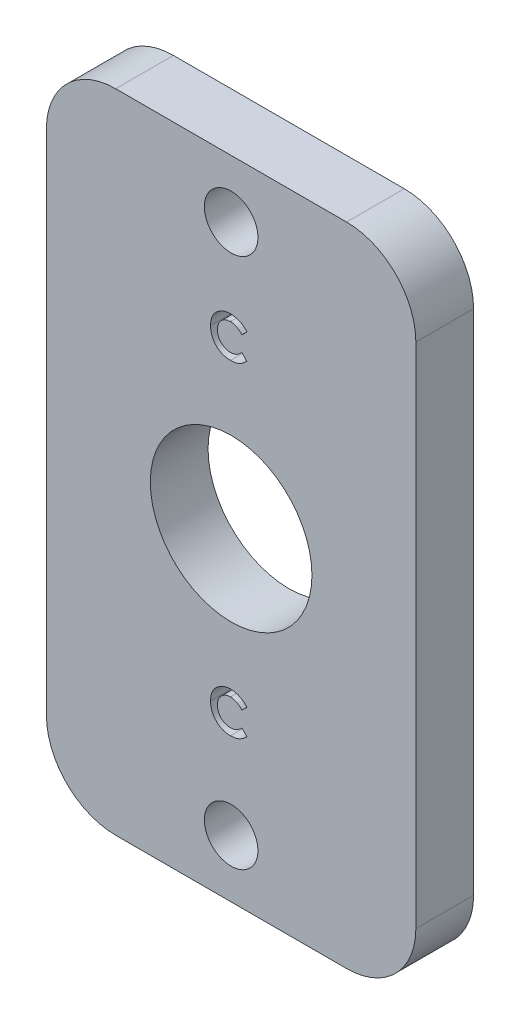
ISO-10303-21;
HEADER;
FILE_DESCRIPTION(('STEP AP214'),'2;1');
FILE_NAME('part.step','',(''),(''),'','','');
FILE_SCHEMA(('AUTOMOTIVE_DESIGN { 1 0 10303 214 1 1 1 1 }'));
ENDSEC;
DATA;
#1=APPLICATION_CONTEXT('core data for automotive mechanical design processes');
#2=APPLICATION_PROTOCOL_DEFINITION('international standard','automotive_design',2000,#1);
#3=PRODUCT_CONTEXT('',#1,'mechanical');
#4=PRODUCT('Part','Part','',(#3));
#5=PRODUCT_RELATED_PRODUCT_CATEGORY('part','',(#4));
#6=PRODUCT_DEFINITION_FORMATION('','',#4);
#7=PRODUCT_DEFINITION_CONTEXT('part definition',#1,'design');
#8=PRODUCT_DEFINITION('design','',#6,#7);
#9=PRODUCT_DEFINITION_SHAPE('','',#8);
#10=(LENGTH_UNIT() NAMED_UNIT(*) SI_UNIT(.MILLI.,.METRE.));
#11=(NAMED_UNIT(*) PLANE_ANGLE_UNIT() SI_UNIT($,.RADIAN.));
#12=(NAMED_UNIT(*) SI_UNIT($,.STERADIAN.) SOLID_ANGLE_UNIT());
#13=UNCERTAINTY_MEASURE_WITH_UNIT(LENGTH_MEASURE(1.E-05),#10,'distance_accuracy_value','');
#14=(GEOMETRIC_REPRESENTATION_CONTEXT(3) GLOBAL_UNCERTAINTY_ASSIGNED_CONTEXT((#13)) GLOBAL_UNIT_ASSIGNED_CONTEXT((#10,
#11,#12)) REPRESENTATION_CONTEXT('',''));
#15=CARTESIAN_POINT('',(0.,0.,0.));
#16=DIRECTION('',(0.,0.,1.));
#17=DIRECTION('',(1.,0.,0.));
#18=AXIS2_PLACEMENT_3D('',#15,#16,#17);
#19=CARTESIAN_POINT('',(0.,0.,3.175));
#20=DIRECTION('',(0.,0.,-1.));
#21=DIRECTION('',(-1.,0.,0.));
#22=AXIS2_PLACEMENT_3D('',#19,#20,#21);
#23=PLANE('',#22);
#24=CARTESIAN_POINT('',(10.1306583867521,28.0027577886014,3.175));
#25=CARTESIAN_POINT('',(10.1520110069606,28.0024379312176,3.175));
#26=CARTESIAN_POINT('',(10.1944942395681,28.0018015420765,3.175));
#27=CARTESIAN_POINT('',(10.2577589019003,27.9964965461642,3.175));
#28=CARTESIAN_POINT('',(10.3205176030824,27.9881651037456,3.175));
#29=CARTESIAN_POINT('',(10.3825456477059,27.9755947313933,3.175));
#30=CARTESIAN_POINT('',(10.444286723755,27.9606721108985,3.175));
#31=CARTESIAN_POINT('',(10.5049294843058,27.9411329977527,3.175));
#32=CARTESIAN_POINT('',(10.5654306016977,27.9193529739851,3.175));
#33=CARTESIAN_POINT('',(10.6248412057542,27.8933194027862,3.175));
#34=CARTESIAN_POINT('',(10.6832442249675,27.8649014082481,3.175));
#35=CARTESIAN_POINT('',(10.7392714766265,27.8326601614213,3.175));
#36=CARTESIAN_POINT('',(10.7938636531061,27.7985797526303,3.175));
#37=CARTESIAN_POINT('',(10.8458110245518,27.7606431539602,3.175));
#38=CARTESIAN_POINT('',(10.8960866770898,27.7202263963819,3.175));
#39=CARTESIAN_POINT('',(10.9444277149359,27.6771409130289,3.175));
#40=CARTESIAN_POINT('',(10.9904099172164,27.6306683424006,3.175));
#41=CARTESIAN_POINT('',(11.0192657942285,27.5978327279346,3.175));
#42=CARTESIAN_POINT('',(11.0338034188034,27.5812901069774,3.175));
#43=B_SPLINE_CURVE_WITH_KNOTS('',3,(#24,#25,#26,#27,#28,#29,#30,#31,#32,#33,#34,#35,#36,#37,#38,
#39,#40,#41,#42),.UNSPECIFIED.,.F.,.F.,(4,1,1,1,1,1,1,1,1,1,1,1,1,1,1,1,4),(0.,
0.0622757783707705,0.123904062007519,0.185067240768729,0.246840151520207,0.308435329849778,
0.370241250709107,0.432586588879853,0.495924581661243,0.559351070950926,0.62194265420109,
0.684392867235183,0.746985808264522,0.809441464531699,0.872507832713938,0.935769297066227,1.),.UNSPECIFIED.);
#44=CARTESIAN_POINT('',(10.1306583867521,28.0027577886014,3.175));
#45=VERTEX_POINT('',#44);
#46=CARTESIAN_POINT('',(11.0338034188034,27.5812901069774,3.175));
#47=VERTEX_POINT('',#46);
#48=EDGE_CURVE('E233',#45,#47,#43,.T.);
#49=ORIENTED_EDGE('',*,*,#48,.T.);
#50=DIRECTION('',(-0.722880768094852,-0.690972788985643,0.));
#51=VECTOR('',#50,1.);
#52=CARTESIAN_POINT('',(11.0338034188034,27.5812901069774,3.175));
#53=LINE('',#52,#51);
#54=CARTESIAN_POINT('',(10.7552276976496,27.3150107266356,3.175));
#55=VERTEX_POINT('',#54);
#56=EDGE_CURVE('E295',#47,#55,#53,.T.);
#57=ORIENTED_EDGE('',*,*,#56,.T.);
#58=CARTESIAN_POINT('',(10.7552276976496,27.3150107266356,3.175));
#59=CARTESIAN_POINT('',(10.7315966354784,27.339445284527,3.175));
#60=CARTESIAN_POINT('',(10.6854377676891,27.3871736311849,3.175));
#61=CARTESIAN_POINT('',(10.6110584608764,27.4503617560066,3.175));
#62=CARTESIAN_POINT('',(10.5337066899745,27.5030205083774,3.175));
#63=CARTESIAN_POINT('',(10.4548871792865,27.5473693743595,3.175));
#64=CARTESIAN_POINT('',(10.3731821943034,27.5809224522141,3.175));
#65=CARTESIAN_POINT('',(10.2895364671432,27.6053731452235,3.175));
#66=CARTESIAN_POINT('',(10.2034158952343,27.6202798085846,3.175));
#67=CARTESIAN_POINT('',(10.1451328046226,27.6219853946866,3.175));
#68=CARTESIAN_POINT('',(10.1158179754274,27.6228432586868,3.175));
#69=B_SPLINE_CURVE_WITH_KNOTS('',3,(#58,#59,#60,#61,#62,#63,#64,#65,#66,#67,#68),.UNSPECIFIED.,
.F.,.F.,(4,1,1,1,1,1,1,1,4),(0.,0.139406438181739,0.272304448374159,0.399525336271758,
0.522810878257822,0.642662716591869,0.761022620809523,0.879800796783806,1.),.UNSPECIFIED.);
#70=CARTESIAN_POINT('',(10.1158179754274,27.6228432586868,3.175));
#71=VERTEX_POINT('',#70);
#72=EDGE_CURVE('E301',#55,#71,#69,.T.);
#73=ORIENTED_EDGE('',*,*,#72,.T.);
#74=CARTESIAN_POINT('',(10.1158179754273,27.6228432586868,3.175));
#75=CARTESIAN_POINT('',(10.0913365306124,27.6221655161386,3.175));
#76=CARTESIAN_POINT('',(10.0430250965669,27.6208280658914,3.175));
#77=CARTESIAN_POINT('',(9.97209125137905,27.6110232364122,3.175));
#78=CARTESIAN_POINT('',(9.9042393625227,27.5943496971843,3.175));
#79=CARTESIAN_POINT('',(9.83923716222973,27.5713704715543,3.175));
#80=CARTESIAN_POINT('',(9.77727592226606,27.5416365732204,3.175));
#81=CARTESIAN_POINT('',(9.71822573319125,27.5051710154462,3.175));
#82=CARTESIAN_POINT('',(9.66223218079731,27.4623031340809,3.175));
#83=CARTESIAN_POINT('',(9.61003490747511,27.4132547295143,3.175));
#84=CARTESIAN_POINT('',(9.5622866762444,27.359665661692,3.175));
#85=CARTESIAN_POINT('',(9.52009807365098,27.3024862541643,3.175));
#86=CARTESIAN_POINT('',(9.48475835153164,27.2418475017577,3.175));
#87=CARTESIAN_POINT('',(9.45575561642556,27.1783635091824,3.175));
#88=CARTESIAN_POINT('',(9.4331636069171,27.1117404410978,3.175));
#89=CARTESIAN_POINT('',(9.4170300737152,27.0420231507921,3.175));
#90=CARTESIAN_POINT('',(9.40769886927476,26.9691286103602,3.175));
#91=CARTESIAN_POINT('',(9.40630612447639,26.9195754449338,3.175));
#92=CARTESIAN_POINT('',(9.40559829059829,26.8943910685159,3.175));
#93=B_SPLINE_CURVE_WITH_KNOTS('',3,(#74,#75,#76,#77,#78,#79,#80,#81,#82,#83,#84,#85,#86,#87,#88,
#89,#90,#91,#92),.UNSPECIFIED.,.F.,.F.,(4,1,1,1,1,1,1,1,1,1,1,1,1,1,1,1,4),(0.,
0.0647145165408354,0.127706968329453,0.188882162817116,0.24915829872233,0.309661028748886,
0.370224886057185,0.432332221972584,0.495781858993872,0.559304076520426,0.621860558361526,
0.683321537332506,0.744522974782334,0.80608837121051,0.868994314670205,0.933419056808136,1.),.UNSPECIFIED.);
#94=CARTESIAN_POINT('',(9.40559829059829,26.8943910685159,3.175));
#95=VERTEX_POINT('',#94);
#96=EDGE_CURVE('E306',#71,#95,#93,.T.);
#97=ORIENTED_EDGE('',*,*,#96,.T.);
#98=CARTESIAN_POINT('',(9.40559829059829,26.8943910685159,3.175));
#99=CARTESIAN_POINT('',(9.40580228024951,26.8767149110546,3.175));
#100=CARTESIAN_POINT('',(9.40620434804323,26.8418748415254,3.175));
#101=CARTESIAN_POINT('',(9.410605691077,26.7903367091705,3.175));
#102=CARTESIAN_POINT('',(9.41769289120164,26.7403325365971,3.175));
#103=CARTESIAN_POINT('',(9.42794982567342,26.6919380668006,3.175));
#104=CARTESIAN_POINT('',(9.44077622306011,26.6451113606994,3.175));
#105=CARTESIAN_POINT('',(9.45582450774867,26.5994484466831,3.175));
#106=CARTESIAN_POINT('',(9.47470235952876,26.555580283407,3.175));
#107=CARTESIAN_POINT('',(9.49565705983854,26.5129973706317,3.175));
#108=CARTESIAN_POINT('',(9.52002713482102,26.472861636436,3.175));
#109=CARTESIAN_POINT('',(9.54630257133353,26.4345888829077,3.175));
#110=CARTESIAN_POINT('',(9.57479399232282,26.3983667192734,3.175));
#111=CARTESIAN_POINT('',(9.60568593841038,26.3643432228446,3.175));
#112=CARTESIAN_POINT('',(9.63941317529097,26.3330501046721,3.175));
#113=CARTESIAN_POINT('',(9.67510397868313,26.3035463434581,3.175));
#114=CARTESIAN_POINT('',(9.71336040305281,26.2765705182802,3.175));
#115=CARTESIAN_POINT('',(9.75338776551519,26.2514456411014,3.175));
#116=CARTESIAN_POINT('',(9.79553185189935,26.2296194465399,3.175));
#117=CARTESIAN_POINT('',(9.83864919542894,26.2098491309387,3.175));
#118=CARTESIAN_POINT('',(9.88339354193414,26.1937926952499,3.175));
#119=CARTESIAN_POINT('',(9.92922010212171,26.1808497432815,3.175));
#120=CARTESIAN_POINT('',(9.97596510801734,26.1698436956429,3.175));
#121=CARTESIAN_POINT('',(10.0240857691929,26.1630669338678,3.175));
#122=CARTESIAN_POINT('',(10.0731649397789,26.1579349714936,3.175));
#123=CARTESIAN_POINT('',(10.1063342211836,26.1576181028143,3.175));
#124=CARTESIAN_POINT('',(10.1230261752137,26.1574586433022,3.175));
#125=B_SPLINE_CURVE_WITH_KNOTS('',3,(#98,#99,#100,#101,#102,#103,#104,#105,#106,#107,#108,#109,
#110,#111,#112,#113,#114,#115,#116,#117,#118,#119,#120,#121,#122,#123,#124),.UNSPECIFIED.,.F.,
.F.,(4,1,1,1,1,1,1,1,1,1,1,1,1,1,1,1,1,1,1,1,1,1,1,1,4),(0.,0.0459858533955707,
0.0906390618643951,0.134485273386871,0.177331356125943,0.219264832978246,0.260785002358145,
0.30231657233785,0.343435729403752,0.384181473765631,0.424375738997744,0.464181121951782,
0.50401198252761,0.543822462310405,0.583802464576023,0.624418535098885,0.665547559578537,
0.706674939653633,0.747826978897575,0.788895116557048,0.830219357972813,0.871706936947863,
0.913733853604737,0.956587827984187,1.),.UNSPECIFIED.);
#126=CARTESIAN_POINT('',(10.1230261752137,26.1574586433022,3.175));
#127=VERTEX_POINT('',#126);
#128=EDGE_CURVE('E314',#95,#127,#125,.T.);
#129=ORIENTED_EDGE('',*,*,#128,.T.);
#130=CARTESIAN_POINT('',(10.1230261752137,26.1574586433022,3.175));
#131=CARTESIAN_POINT('',(10.1513385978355,26.1582775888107,3.175));
#132=CARTESIAN_POINT('',(10.2069651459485,26.1598866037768,3.175));
#133=CARTESIAN_POINT('',(10.288605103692,26.1724688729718,3.175));
#134=CARTESIAN_POINT('',(10.3663998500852,26.1931659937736,3.175));
#135=CARTESIAN_POINT('',(10.4285574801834,26.217608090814,3.175));
#136=CARTESIAN_POINT('',(10.4772563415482,26.2417449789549,3.175));
#137=CARTESIAN_POINT('',(10.5143300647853,26.2640704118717,3.175));
#138=CARTESIAN_POINT('',(10.552667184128,26.2890438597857,3.175));
#139=CARTESIAN_POINT('',(10.5916309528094,26.3176078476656,3.175));
#140=CARTESIAN_POINT('',(10.6316596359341,26.349419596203,3.175));
#141=CARTESIAN_POINT('',(10.6720466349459,26.3851758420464,3.175));
#142=CARTESIAN_POINT('',(10.7138258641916,26.4236991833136,3.175));
#143=CARTESIAN_POINT('',(10.7411950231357,26.4511940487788,3.175));
#144=CARTESIAN_POINT('',(10.7552276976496,26.4652911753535,3.175));
#145=B_SPLINE_CURVE_WITH_KNOTS('',3,(#130,#131,#132,#133,#134,#135,#136,#137,#138,#139,#140,
#141,#142,#143,#144),.UNSPECIFIED.,.F.,.F.,(4,1,1,1,1,1,1,1,1,1,1,1,4),(0.,0.117048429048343,
0.229969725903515,0.340703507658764,0.449355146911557,0.505556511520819,0.565302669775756,
0.628204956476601,0.694728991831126,0.765018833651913,0.83958020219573,0.917749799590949,1.),.UNSPECIFIED.);
#146=CARTESIAN_POINT('',(10.7552276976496,26.4652911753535,3.175));
#147=VERTEX_POINT('',#146);
#148=EDGE_CURVE('E322',#127,#147,#145,.T.);
#149=ORIENTED_EDGE('',*,*,#148,.T.);
#150=DIRECTION('',(0.689574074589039,-0.72421515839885,0.));
#151=VECTOR('',#150,1.);
#152=CARTESIAN_POINT('',(10.7552276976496,26.4652911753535,3.175));
#153=LINE('',#152,#151);
#154=CARTESIAN_POINT('',(11.0253231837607,26.181627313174,3.175));
#155=VERTEX_POINT('',#154);
#156=EDGE_CURVE('E330',#147,#155,#153,.T.);
#157=ORIENTED_EDGE('',*,*,#156,.T.);
#158=CARTESIAN_POINT('',(11.0253231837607,26.181627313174,3.175));
#159=CARTESIAN_POINT('',(11.0063369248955,26.1632966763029,3.175));
#160=CARTESIAN_POINT('',(10.9692798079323,26.127519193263,3.175));
#161=CARTESIAN_POINT('',(10.9133801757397,26.076718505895,3.175));
#162=CARTESIAN_POINT('',(10.8575508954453,26.0310684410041,3.175));
#163=CARTESIAN_POINT('',(10.803140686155,25.9889121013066,3.175));
#164=CARTESIAN_POINT('',(10.7492582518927,25.9514776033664,3.175));
#165=CARTESIAN_POINT('',(10.6959093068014,25.9187275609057,3.175));
#166=CARTESIAN_POINT('',(10.6436977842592,25.8898336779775,3.175));
#167=CARTESIAN_POINT('',(10.5915394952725,25.8652832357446,3.175));
#168=CARTESIAN_POINT('',(10.5391098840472,25.8444373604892,3.175));
#169=CARTESIAN_POINT('',(10.4851659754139,25.8264904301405,3.175));
#170=CARTESIAN_POINT('',(10.429542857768,25.8113079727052,3.175));
#171=CARTESIAN_POINT('',(10.3719008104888,25.7990577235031,3.175));
#172=CARTESIAN_POINT('',(10.3127774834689,25.7892346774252,3.175));
#173=CARTESIAN_POINT('',(10.2516195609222,25.7826041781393,3.175));
#174=CARTESIAN_POINT('',(10.1888148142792,25.7781467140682,3.175));
#175=CARTESIAN_POINT('',(10.1462133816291,25.7777461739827,3.175));
#176=CARTESIAN_POINT('',(10.1247222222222,25.7775441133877,3.175));
#177=B_SPLINE_CURVE_WITH_KNOTS('',3,(#158,#159,#160,#161,#162,#163,#164,#165,#166,#167,#168,
#169,#170,#171,#172,#173,#174,#175,#176),.UNSPECIFIED.,.F.,.F.,(4,1,1,1,1,1,1,1,1,1,1,1,1,1,1,1,
4),(0.,0.0777829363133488,0.151815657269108,0.222539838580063,0.290277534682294,
0.354640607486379,0.415797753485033,0.474709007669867,0.530426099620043,0.585579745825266,
0.640906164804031,0.697901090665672,0.755420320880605,0.81452125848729,0.874461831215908,
0.936669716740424,1.),.UNSPECIFIED.);
#178=CARTESIAN_POINT('',(10.1247222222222,25.7775441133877,3.175));
#179=VERTEX_POINT('',#178);
#180=EDGE_CURVE('E336',#155,#179,#177,.T.);
#181=ORIENTED_EDGE('',*,*,#180,.T.);
#182=CARTESIAN_POINT('',(10.1247222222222,25.7775441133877,3.175));
#183=CARTESIAN_POINT('',(10.0852456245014,25.7785504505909,3.175));
#184=CARTESIAN_POINT('',(10.008000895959,25.780519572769,3.175));
#185=CARTESIAN_POINT('',(9.89480076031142,25.7951094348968,3.175));
#186=CARTESIAN_POINT('',(9.78726367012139,25.8195690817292,3.175));
#187=CARTESIAN_POINT('',(9.68512800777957,25.8541617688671,3.175));
#188=CARTESIAN_POINT('',(9.58842625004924,25.8983523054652,3.175));
#189=CARTESIAN_POINT('',(9.49718313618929,25.9525278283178,3.175));
#190=CARTESIAN_POINT('',(9.41154572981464,26.0165444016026,3.175));
#191=CARTESIAN_POINT('',(9.33220581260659,26.0896516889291,3.175));
#192=CARTESIAN_POINT('',(9.26043908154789,26.1703925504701,3.175));
#193=CARTESIAN_POINT('',(9.19700560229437,26.2570860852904,3.175));
#194=CARTESIAN_POINT('',(9.14453342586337,26.3501583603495,3.175));
#195=CARTESIAN_POINT('',(9.10096464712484,26.4482344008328,3.175));
#196=CARTESIAN_POINT('',(9.0668944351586,26.5517617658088,3.175));
#197=CARTESIAN_POINT('',(9.04291478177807,26.6608524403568,3.175));
#198=CARTESIAN_POINT('',(9.02812670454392,26.7754010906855,3.175));
#199=CARTESIAN_POINT('',(9.02650886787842,26.8536404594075,3.175));
#200=CARTESIAN_POINT('',(9.02568376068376,26.8935430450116,3.175));
#201=B_SPLINE_CURVE_WITH_KNOTS('',3,(#182,#183,#184,#185,#186,#187,#188,#189,#190,#191,#192,
#193,#194,#195,#196,#197,#198,#199,#200),.UNSPECIFIED.,.F.,.F.,(4,1,1,1,1,1,1,1,1,1,1,1,1,1,1,1,
4),(0.,0.0673762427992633,0.13183657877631,0.194461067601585,0.255345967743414,
0.315588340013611,0.375627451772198,0.436137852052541,0.497778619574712,0.559470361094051,
0.620277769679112,0.680787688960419,0.741491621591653,0.803215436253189,0.86649276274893,
0.931910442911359,1.),.UNSPECIFIED.);
#202=CARTESIAN_POINT('',(9.02568376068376,26.8935430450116,3.175));
#203=VERTEX_POINT('',#202);
#204=EDGE_CURVE('E341',#179,#203,#201,.T.);
#205=ORIENTED_EDGE('',*,*,#204,.T.);
#206=CARTESIAN_POINT('',(9.02568376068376,26.8935430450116,3.175));
#207=CARTESIAN_POINT('',(9.02603241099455,26.9195671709,3.175));
#208=CARTESIAN_POINT('',(9.02672335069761,26.9711406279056,3.175));
#209=CARTESIAN_POINT('',(9.03398519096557,27.0471125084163,3.175));
#210=CARTESIAN_POINT('',(9.0441086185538,27.1211715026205,3.175));
#211=CARTESIAN_POINT('',(9.06016851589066,27.1925486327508,3.175));
#212=CARTESIAN_POINT('',(9.07952713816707,27.2622054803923,3.175));
#213=CARTESIAN_POINT('',(9.10360212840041,27.3293849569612,3.175));
#214=CARTESIAN_POINT('',(9.13235503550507,27.3942801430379,3.175));
#215=CARTESIAN_POINT('',(9.16485908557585,27.4569996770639,3.175));
#216=CARTESIAN_POINT('',(9.20163059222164,27.5171326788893,3.175));
#217=CARTESIAN_POINT('',(9.24270840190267,27.5741625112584,3.175));
#218=CARTESIAN_POINT('',(9.28703501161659,27.6285294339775,3.175));
#219=CARTESIAN_POINT('',(9.3356755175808,27.6795121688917,3.175));
#220=CARTESIAN_POINT('',(9.3879231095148,27.727558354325,3.175));
#221=CARTESIAN_POINT('',(9.44401367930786,27.7724076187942,3.175));
#222=CARTESIAN_POINT('',(9.50360987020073,27.8147031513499,3.175));
#223=CARTESIAN_POINT('',(9.56687298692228,27.8533542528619,3.175));
#224=CARTESIAN_POINT('',(9.63257399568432,27.8883162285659,3.175));
#225=CARTESIAN_POINT('',(9.69988423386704,27.9191541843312,3.175));
#226=CARTESIAN_POINT('',(9.7686383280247,27.9449276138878,3.175));
#227=CARTESIAN_POINT('',(9.83854557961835,27.9663057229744,3.175));
#228=CARTESIAN_POINT('',(9.90990134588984,27.9822629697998,3.175));
#229=CARTESIAN_POINT('',(9.98219630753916,27.99434209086,3.175));
#230=CARTESIAN_POINT('',(10.0560456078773,28.001094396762,3.175));
#231=CARTESIAN_POINT('',(10.1056290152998,28.0021997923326,3.175));
#232=CARTESIAN_POINT('',(10.1306583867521,28.0027577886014,3.175));
#233=B_SPLINE_CURVE_WITH_KNOTS('',3,(#206,#207,#208,#209,#210,#211,#212,#213,#214,#215,#216,
#217,#218,#219,#220,#221,#222,#223,#224,#225,#226,#227,#228,#229,#230,#231,#232),.UNSPECIFIED.,
.F.,.F.,(4,1,1,1,1,1,1,1,1,1,1,1,1,1,1,1,1,1,1,1,1,1,1,1,4),(0.,0.0446633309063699,
0.0885118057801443,0.130925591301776,0.172904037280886,0.214000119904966,0.254985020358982,
0.295291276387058,0.335772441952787,0.37618082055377,0.41617840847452,0.456350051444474,
0.496512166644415,0.53704057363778,0.578118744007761,0.619724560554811,0.662421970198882,
0.705298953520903,0.747430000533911,0.789432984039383,0.831267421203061,0.872825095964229,
0.914870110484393,0.957027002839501,1.),.UNSPECIFIED.);
#234=EDGE_CURVE('E349',#203,#45,#233,.T.);
#235=ORIENTED_EDGE('',*,*,#234,.T.);
#236=EDGE_LOOP('',(#49,#57,#73,#97,#129,#149,#157,#181,#205,#235));
#237=FACE_BOUND('',#236,.T.);
#238=CARTESIAN_POINT('',(10.16,3.175,3.175));
#239=DIRECTION('',(0.,0.,1.));
#240=DIRECTION('',(1.,0.,0.));
#241=AXIS2_PLACEMENT_3D('',#238,#239,#240);
#242=CIRCLE('',#241,1.47319999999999);
#243=CARTESIAN_POINT('',(11.6332,3.175,3.175));
#244=VERTEX_POINT('',#243);
#245=EDGE_CURVE('E382',#244,#244,#242,.T.);
#246=ORIENTED_EDGE('',*,*,#245,.F.);
#247=EDGE_LOOP('',(#246));
#248=FACE_BOUND('',#247,.T.);
#249=CARTESIAN_POINT('',(10.16,32.385,3.175));
#250=DIRECTION('',(0.,0.,1.));
#251=DIRECTION('',(1.,0.,0.));
#252=AXIS2_PLACEMENT_3D('',#249,#250,#251);
#253=CIRCLE('',#252,1.47319999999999);
#254=CARTESIAN_POINT('',(11.6332,32.385,3.175));
#255=VERTEX_POINT('',#254);
#256=EDGE_CURVE('E388',#255,#255,#253,.T.);
#257=ORIENTED_EDGE('',*,*,#256,.F.);
#258=EDGE_LOOP('',(#257));
#259=FACE_BOUND('',#258,.T.);
#260=DIRECTION('',(0.,-1.,0.));
#261=VECTOR('',#260,1.);
#262=CARTESIAN_POINT('',(0.,0.,3.175));
#263=LINE('',#262,#261);
#264=CARTESIAN_POINT('',(0.,31.75,3.175));
#265=VERTEX_POINT('',#264);
#266=CARTESIAN_POINT('',(0.,3.81,3.175));
#267=VERTEX_POINT('',#266);
#268=EDGE_CURVE('E401',#265,#267,#263,.T.);
#269=ORIENTED_EDGE('',*,*,#268,.T.);
#270=CARTESIAN_POINT('',(3.81,3.81,3.175));
#271=DIRECTION('',(0.,0.,-1.));
#272=DIRECTION('',(-1.,0.,0.));
#273=AXIS2_PLACEMENT_3D('',#270,#271,#272);
#274=CIRCLE('',#273,3.81);
#275=CARTESIAN_POINT('',(3.81,0.,3.175));
#276=VERTEX_POINT('',#275);
#277=EDGE_CURVE('E448',#267,#276,#274,.F.);
#278=ORIENTED_EDGE('',*,*,#277,.T.);
#279=DIRECTION('',(1.,0.,0.));
#280=VECTOR('',#279,1.);
#281=CARTESIAN_POINT('',(0.,0.,3.175));
#282=LINE('',#281,#280);
#283=CARTESIAN_POINT('',(16.51,0.,3.175));
#284=VERTEX_POINT('',#283);
#285=EDGE_CURVE('E404',#276,#284,#282,.T.);
#286=ORIENTED_EDGE('',*,*,#285,.T.);
#287=CARTESIAN_POINT('',(16.51,3.81,3.175));
#288=DIRECTION('',(0.,0.,-1.));
#289=DIRECTION('',(-1.,0.,0.));
#290=AXIS2_PLACEMENT_3D('',#287,#288,#289);
#291=CIRCLE('',#290,3.81);
#292=CARTESIAN_POINT('',(20.32,3.81,3.175));
#293=VERTEX_POINT('',#292);
#294=EDGE_CURVE('E446',#284,#293,#291,.F.);
#295=ORIENTED_EDGE('',*,*,#294,.T.);
#296=DIRECTION('',(0.,1.,0.));
#297=VECTOR('',#296,1.);
#298=CARTESIAN_POINT('',(20.32,0.,3.175));
#299=LINE('',#298,#297);
#300=CARTESIAN_POINT('',(20.32,31.75,3.175));
#301=VERTEX_POINT('',#300);
#302=EDGE_CURVE('E408',#293,#301,#299,.T.);
#303=ORIENTED_EDGE('',*,*,#302,.T.);
#304=CARTESIAN_POINT('',(16.51,31.75,3.175));
#305=DIRECTION('',(0.,0.,-1.));
#306=DIRECTION('',(-1.,0.,0.));
#307=AXIS2_PLACEMENT_3D('',#304,#305,#306);
#308=CIRCLE('',#307,3.81);
#309=CARTESIAN_POINT('',(16.51,35.56,3.175));
#310=VERTEX_POINT('',#309);
#311=EDGE_CURVE('E444',#301,#310,#308,.F.);
#312=ORIENTED_EDGE('',*,*,#311,.T.);
#313=DIRECTION('',(-1.,0.,0.));
#314=VECTOR('',#313,1.);
#315=CARTESIAN_POINT('',(0.,35.56,3.175));
#316=LINE('',#315,#314);
#317=CARTESIAN_POINT('',(3.81,35.56,3.175));
#318=VERTEX_POINT('',#317);
#319=EDGE_CURVE('E411',#310,#318,#316,.T.);
#320=ORIENTED_EDGE('',*,*,#319,.T.);
#321=CARTESIAN_POINT('',(3.81,31.75,3.175));
#322=DIRECTION('',(0.,0.,-1.));
#323=DIRECTION('',(-1.,0.,0.));
#324=AXIS2_PLACEMENT_3D('',#321,#322,#323);
#325=CIRCLE('',#324,3.81);
#326=EDGE_CURVE('E442',#318,#265,#325,.F.);
#327=ORIENTED_EDGE('',*,*,#326,.T.);
#328=EDGE_LOOP('',(#269,#278,#286,#295,#303,#312,#320,#327));
#329=FACE_BOUND('',#328,.T.);
#330=CARTESIAN_POINT('',(10.16,17.78,3.175));
#331=DIRECTION('',(0.,0.,1.));
#332=DIRECTION('',(1.,0.,0.));
#333=AXIS2_PLACEMENT_3D('',#330,#331,#332);
#334=CIRCLE('',#333,4.445);
#335=CARTESIAN_POINT('',(14.605,17.78,3.175));
#336=VERTEX_POINT('',#335);
#337=EDGE_CURVE('E395',#336,#336,#334,.T.);
#338=ORIENTED_EDGE('',*,*,#337,.F.);
#339=EDGE_LOOP('',(#338));
#340=FACE_BOUND('',#339,.T.);
#341=CARTESIAN_POINT('',(10.1306583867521,10.1216588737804,3.175));
#342=CARTESIAN_POINT('',(10.1520110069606,10.1213390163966,3.175));
#343=CARTESIAN_POINT('',(10.1944942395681,10.1207026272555,3.175));
#344=CARTESIAN_POINT('',(10.2577589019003,10.1153976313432,3.175));
#345=CARTESIAN_POINT('',(10.3205176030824,10.1070661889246,3.175));
#346=CARTESIAN_POINT('',(10.3825456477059,10.0944958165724,3.175));
#347=CARTESIAN_POINT('',(10.444286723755,10.0795731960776,3.175));
#348=CARTESIAN_POINT('',(10.5049294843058,10.0600340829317,3.175));
#349=CARTESIAN_POINT('',(10.5654306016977,10.0382540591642,3.175));
#350=CARTESIAN_POINT('',(10.6248412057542,10.0122204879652,3.175));
#351=CARTESIAN_POINT('',(10.6832442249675,9.98380249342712,3.175));
#352=CARTESIAN_POINT('',(10.7392714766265,9.95156124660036,3.175));
#353=CARTESIAN_POINT('',(10.7938636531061,9.91748083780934,3.175));
#354=CARTESIAN_POINT('',(10.8458110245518,9.87954423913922,3.175));
#355=CARTESIAN_POINT('',(10.8960866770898,9.83912748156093,3.175));
#356=CARTESIAN_POINT('',(10.9444277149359,9.79604199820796,3.175));
#357=CARTESIAN_POINT('',(10.9904099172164,9.74956942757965,3.175));
#358=CARTESIAN_POINT('',(11.0192657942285,9.71673381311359,3.175));
#359=CARTESIAN_POINT('',(11.0338034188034,9.70019119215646,3.175));
#360=B_SPLINE_CURVE_WITH_KNOTS('',3,(#341,#342,#343,#344,#345,#346,#347,#348,#349,#350,#351,
#352,#353,#354,#355,#356,#357,#358,#359),.UNSPECIFIED.,.F.,.F.,(4,1,1,1,1,1,1,1,1,1,1,1,1,1,1,1,
4),(0.,0.0622757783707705,0.123904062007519,0.185067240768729,0.246840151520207,
0.308435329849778,0.370241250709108,0.432586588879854,0.495924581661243,0.559351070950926,
0.621942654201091,0.684392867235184,0.746985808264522,0.809441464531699,0.872507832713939,
0.935769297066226,1.),.UNSPECIFIED.);
#361=CARTESIAN_POINT('',(10.1306583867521,10.1216588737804,3.175));
#362=VERTEX_POINT('',#361);
#363=CARTESIAN_POINT('',(11.0338034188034,9.70019119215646,3.175));
#364=VERTEX_POINT('',#363);
#365=EDGE_CURVE('E47',#362,#364,#360,.T.);
#366=ORIENTED_EDGE('',*,*,#365,.T.);
#367=DIRECTION('',(-0.722880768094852,-0.690972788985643,0.));
#368=VECTOR('',#367,1.);
#369=CARTESIAN_POINT('',(11.0338034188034,9.70019119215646,3.175));
#370=LINE('',#369,#368);
#371=CARTESIAN_POINT('',(10.7552276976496,9.43391181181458,3.175));
#372=VERTEX_POINT('',#371);
#373=EDGE_CURVE('E232',#364,#372,#370,.T.);
#374=ORIENTED_EDGE('',*,*,#373,.T.);
#375=CARTESIAN_POINT('',(10.7552276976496,9.43391181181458,3.175));
#376=CARTESIAN_POINT('',(10.7315966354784,9.45834636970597,3.175));
#377=CARTESIAN_POINT('',(10.6854377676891,9.50607471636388,3.175));
#378=CARTESIAN_POINT('',(10.6110584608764,9.56926284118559,3.175));
#379=CARTESIAN_POINT('',(10.5337066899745,9.62192159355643,3.175));
#380=CARTESIAN_POINT('',(10.4548871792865,9.66627045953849,3.175));
#381=CARTESIAN_POINT('',(10.3731821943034,9.69982353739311,3.175));
#382=CARTESIAN_POINT('',(10.2895364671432,9.72427423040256,3.175));
#383=CARTESIAN_POINT('',(10.2034158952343,9.73918089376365,3.175));
#384=CARTESIAN_POINT('',(10.1451328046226,9.74088647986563,3.175));
#385=CARTESIAN_POINT('',(10.1158179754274,9.74174434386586,3.175));
#386=B_SPLINE_CURVE_WITH_KNOTS('',3,(#375,#376,#377,#378,#379,#380,#381,#382,#383,#384,#385),
.UNSPECIFIED.,.F.,.F.,(4,1,1,1,1,1,1,1,4),(0.,0.139406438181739,0.272304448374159,
0.39952533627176,0.522810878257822,0.642662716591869,0.761022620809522,0.879800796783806,1.),.UNSPECIFIED.);
#387=CARTESIAN_POINT('',(10.1158179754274,9.74174434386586,3.175));
#388=VERTEX_POINT('',#387);
#389=EDGE_CURVE('E797',#372,#388,#386,.T.);
#390=ORIENTED_EDGE('',*,*,#389,.T.);
#391=CARTESIAN_POINT('',(10.1158179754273,9.74174434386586,3.175));
#392=CARTESIAN_POINT('',(10.0913365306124,9.74106660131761,3.175));
#393=CARTESIAN_POINT('',(10.0430250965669,9.7397291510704,3.175));
#394=CARTESIAN_POINT('',(9.97209125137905,9.72992432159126,3.175));
#395=CARTESIAN_POINT('',(9.9042393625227,9.71325078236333,3.175));
#396=CARTESIAN_POINT('',(9.83923716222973,9.69027155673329,3.175));
#397=CARTESIAN_POINT('',(9.77727592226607,9.66053765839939,3.175));
#398=CARTESIAN_POINT('',(9.71822573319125,9.62407210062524,3.175));
#399=CARTESIAN_POINT('',(9.66223218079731,9.58120421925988,3.175));
#400=CARTESIAN_POINT('',(9.61003490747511,9.53215581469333,3.175));
#401=CARTESIAN_POINT('',(9.5622866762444,9.47856674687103,3.175));
#402=CARTESIAN_POINT('',(9.52009807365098,9.42138733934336,3.175));
#403=CARTESIAN_POINT('',(9.48475835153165,9.36074858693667,3.175));
#404=CARTESIAN_POINT('',(9.45575561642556,9.29726459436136,3.175));
#405=CARTESIAN_POINT('',(9.4331636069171,9.23064152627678,3.175));
#406=CARTESIAN_POINT('',(9.4170300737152,9.16092423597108,3.175));
#407=CARTESIAN_POINT('',(9.40769886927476,9.08802969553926,3.175));
#408=CARTESIAN_POINT('',(9.4063061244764,9.03847653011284,3.175));
#409=CARTESIAN_POINT('',(9.40559829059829,9.01329215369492,3.175));
#410=B_SPLINE_CURVE_WITH_KNOTS('',3,(#391,#392,#393,#394,#395,#396,#397,#398,#399,#400,#401,
#402,#403,#404,#405,#406,#407,#408,#409),.UNSPECIFIED.,.F.,.F.,(4,1,1,1,1,1,1,1,1,1,1,1,1,1,1,1,
4),(0.,0.0647145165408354,0.127706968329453,0.188882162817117,0.24915829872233,
0.309661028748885,0.370224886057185,0.432332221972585,0.495781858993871,0.559304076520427,
0.621860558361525,0.683321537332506,0.744522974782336,0.806088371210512,0.868994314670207,
0.933419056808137,1.),.UNSPECIFIED.);
#411=CARTESIAN_POINT('',(9.40559829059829,9.01329215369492,3.175));
#412=VERTEX_POINT('',#411);
#413=EDGE_CURVE('E802',#388,#412,#410,.T.);
#414=ORIENTED_EDGE('',*,*,#413,.T.);
#415=CARTESIAN_POINT('',(9.40559829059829,9.01329215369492,3.175));
#416=CARTESIAN_POINT('',(9.40580228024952,8.99561599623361,3.175));
#417=CARTESIAN_POINT('',(9.40620434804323,8.96077592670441,3.175));
#418=CARTESIAN_POINT('',(9.410605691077,8.90923779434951,3.175));
#419=CARTESIAN_POINT('',(9.41769289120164,8.85923362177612,3.175));
#420=CARTESIAN_POINT('',(9.42794982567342,8.81083915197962,3.175));
#421=CARTESIAN_POINT('',(9.44077622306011,8.76401244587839,3.175));
#422=CARTESIAN_POINT('',(9.45582450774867,8.71834953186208,3.175));
#423=CARTESIAN_POINT('',(9.47470235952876,8.67448136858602,3.175));
#424=CARTESIAN_POINT('',(9.49565705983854,8.63189845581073,3.175));
#425=CARTESIAN_POINT('',(9.52002713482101,8.59176272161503,3.175));
#426=CARTESIAN_POINT('',(9.54630257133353,8.55348996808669,3.175));
#427=CARTESIAN_POINT('',(9.57479399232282,8.51726780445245,3.175));
#428=CARTESIAN_POINT('',(9.60568593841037,8.48324430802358,3.175));
#429=CARTESIAN_POINT('',(9.63941317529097,8.45195118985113,3.175));
#430=CARTESIAN_POINT('',(9.67510397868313,8.42244742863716,3.175));
#431=CARTESIAN_POINT('',(9.71336040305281,8.39547160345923,3.175));
#432=CARTESIAN_POINT('',(9.75338776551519,8.37034672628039,3.175));
#433=CARTESIAN_POINT('',(9.79553185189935,8.34852053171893,3.175));
#434=CARTESIAN_POINT('',(9.83864919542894,8.32875021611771,3.175));
#435=CARTESIAN_POINT('',(9.88339354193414,8.31269378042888,3.175));
#436=CARTESIAN_POINT('',(9.92922010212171,8.29975082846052,3.175));
#437=CARTESIAN_POINT('',(9.97596510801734,8.2887447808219,3.175));
#438=CARTESIAN_POINT('',(10.0240857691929,8.28196801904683,3.175));
#439=CARTESIAN_POINT('',(10.0731649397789,8.27683605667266,3.175));
#440=CARTESIAN_POINT('',(10.1063342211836,8.27651918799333,3.175));
#441=CARTESIAN_POINT('',(10.1230261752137,8.27635972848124,3.175));
#442=B_SPLINE_CURVE_WITH_KNOTS('',3,(#415,#416,#417,#418,#419,#420,#421,#422,#423,#424,#425,
#426,#427,#428,#429,#430,#431,#432,#433,#434,#435,#436,#437,#438,#439,#440,#441),.UNSPECIFIED.,
.F.,.F.,(4,1,1,1,1,1,1,1,1,1,1,1,1,1,1,1,1,1,1,1,1,1,1,1,4),(0.,0.0459858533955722,
0.0906390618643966,0.134485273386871,0.177331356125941,0.219264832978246,0.260785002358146,
0.30231657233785,0.343435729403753,0.384181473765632,0.424375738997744,0.464181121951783,
0.504011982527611,0.543822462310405,0.583802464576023,0.624418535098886,0.665547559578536,
0.706674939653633,0.747826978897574,0.788895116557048,0.830219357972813,0.871706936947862,
0.913733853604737,0.956587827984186,1.),.UNSPECIFIED.);
#443=CARTESIAN_POINT('',(10.1230261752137,8.27635972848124,3.175));
#444=VERTEX_POINT('',#443);
#445=EDGE_CURVE('E810',#412,#444,#442,.T.);
#446=ORIENTED_EDGE('',*,*,#445,.T.);
#447=CARTESIAN_POINT('',(10.1230261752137,8.27635972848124,3.175));
#448=CARTESIAN_POINT('',(10.1513385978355,8.27717867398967,3.175));
#449=CARTESIAN_POINT('',(10.2069651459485,8.2787876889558,3.175));
#450=CARTESIAN_POINT('',(10.288605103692,8.2913699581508,3.175));
#451=CARTESIAN_POINT('',(10.3663998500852,8.31206707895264,3.175));
#452=CARTESIAN_POINT('',(10.4285574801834,8.33650917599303,3.175));
#453=CARTESIAN_POINT('',(10.4772563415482,8.36064606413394,3.175));
#454=CARTESIAN_POINT('',(10.5143300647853,8.38297149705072,3.175));
#455=CARTESIAN_POINT('',(10.552667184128,8.40794494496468,3.175));
#456=CARTESIAN_POINT('',(10.5916309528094,8.43650893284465,3.175));
#457=CARTESIAN_POINT('',(10.6316596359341,8.46832068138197,3.175));
#458=CARTESIAN_POINT('',(10.6720466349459,8.50407692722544,3.175));
#459=CARTESIAN_POINT('',(10.7138258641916,8.54260026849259,3.175));
#460=CARTESIAN_POINT('',(10.7411950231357,8.57009513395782,3.175));
#461=CARTESIAN_POINT('',(10.7552276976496,8.58419226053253,3.175));
#462=B_SPLINE_CURVE_WITH_KNOTS('',3,(#447,#448,#449,#450,#451,#452,#453,#454,#455,#456,#457,
#458,#459,#460,#461),.UNSPECIFIED.,.F.,.F.,(4,1,1,1,1,1,1,1,1,1,1,1,4),(0.,0.117048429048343,
0.229969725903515,0.340703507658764,0.449355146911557,0.50555651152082,0.565302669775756,
0.628204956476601,0.694728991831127,0.765018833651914,0.839580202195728,0.917749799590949,1.),.UNSPECIFIED.);
#463=CARTESIAN_POINT('',(10.7552276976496,8.58419226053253,3.175));
#464=VERTEX_POINT('',#463);
#465=EDGE_CURVE('E818',#444,#464,#462,.T.);
#466=ORIENTED_EDGE('',*,*,#465,.T.);
#467=DIRECTION('',(0.689574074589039,-0.72421515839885,0.));
#468=VECTOR('',#467,1.);
#469=CARTESIAN_POINT('',(10.7552276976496,8.58419226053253,3.175));
#470=LINE('',#469,#468);
#471=CARTESIAN_POINT('',(11.0253231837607,8.30052839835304,3.175));
#472=VERTEX_POINT('',#471);
#473=EDGE_CURVE('E826',#464,#472,#470,.T.);
#474=ORIENTED_EDGE('',*,*,#473,.T.);
#475=CARTESIAN_POINT('',(11.0253231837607,8.30052839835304,3.175));
#476=CARTESIAN_POINT('',(11.0063369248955,8.28219776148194,3.175));
#477=CARTESIAN_POINT('',(10.9692798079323,8.24642027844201,3.175));
#478=CARTESIAN_POINT('',(10.9133801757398,8.19561959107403,3.175));
#479=CARTESIAN_POINT('',(10.8575508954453,8.1499695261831,3.175));
#480=CARTESIAN_POINT('',(10.803140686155,8.10781318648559,3.175));
#481=CARTESIAN_POINT('',(10.7492582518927,8.07037868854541,3.175));
#482=CARTESIAN_POINT('',(10.6959093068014,8.03762864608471,3.175));
#483=CARTESIAN_POINT('',(10.6436977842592,8.00873476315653,3.175));
#484=CARTESIAN_POINT('',(10.5915394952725,7.98418432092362,3.175));
#485=CARTESIAN_POINT('',(10.5391098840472,7.96333844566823,3.175));
#486=CARTESIAN_POINT('',(10.4851659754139,7.94539151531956,3.175));
#487=CARTESIAN_POINT('',(10.429542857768,7.93020905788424,3.175));
#488=CARTESIAN_POINT('',(10.3719008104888,7.91795880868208,3.175));
#489=CARTESIAN_POINT('',(10.3127774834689,7.9081357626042,3.175));
#490=CARTESIAN_POINT('',(10.2516195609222,7.90150526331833,3.175));
#491=CARTESIAN_POINT('',(10.1888148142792,7.89704779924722,3.175));
#492=CARTESIAN_POINT('',(10.1462133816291,7.89664725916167,3.175));
#493=CARTESIAN_POINT('',(10.1247222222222,7.89644519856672,3.175));
#494=B_SPLINE_CURVE_WITH_KNOTS('',3,(#475,#476,#477,#478,#479,#480,#481,#482,#483,#484,#485,
#486,#487,#488,#489,#490,#491,#492,#493),.UNSPECIFIED.,.F.,.F.,(4,1,1,1,1,1,1,1,1,1,1,1,1,1,1,1,
4),(0.,0.0777829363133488,0.151815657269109,0.222539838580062,0.290277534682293,
0.35464060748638,0.415797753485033,0.474709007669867,0.530426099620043,0.585579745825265,
0.640906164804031,0.697901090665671,0.755420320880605,0.81452125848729,0.874461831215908,
0.936669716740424,1.),.UNSPECIFIED.);
#495=CARTESIAN_POINT('',(10.1247222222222,7.89644519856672,3.175));
#496=VERTEX_POINT('',#495);
#497=EDGE_CURVE('E832',#472,#496,#494,.T.);
#498=ORIENTED_EDGE('',*,*,#497,.T.);
#499=CARTESIAN_POINT('',(10.1247222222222,7.89644519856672,3.175));
#500=CARTESIAN_POINT('',(10.0852456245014,7.89745153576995,3.175));
#501=CARTESIAN_POINT('',(10.008000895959,7.899420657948,3.175));
#502=CARTESIAN_POINT('',(9.89480076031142,7.91401052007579,3.175));
#503=CARTESIAN_POINT('',(9.7872636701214,7.93847016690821,3.175));
#504=CARTESIAN_POINT('',(9.68512800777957,7.97306285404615,3.175));
#505=CARTESIAN_POINT('',(9.58842625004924,8.01725339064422,3.175));
#506=CARTESIAN_POINT('',(9.4971831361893,8.07142891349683,3.175));
#507=CARTESIAN_POINT('',(9.41154572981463,8.13544548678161,3.175));
#508=CARTESIAN_POINT('',(9.33220581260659,8.20855277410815,3.175));
#509=CARTESIAN_POINT('',(9.2604390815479,8.2892936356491,3.175));
#510=CARTESIAN_POINT('',(9.19700560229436,8.37598717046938,3.175));
#511=CARTESIAN_POINT('',(9.14453342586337,8.4690594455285,3.175));
#512=CARTESIAN_POINT('',(9.10096464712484,8.56713548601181,3.175));
#513=CARTESIAN_POINT('',(9.0668944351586,8.67066285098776,3.175));
#514=CARTESIAN_POINT('',(9.04291478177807,8.77975352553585,3.175));
#515=CARTESIAN_POINT('',(9.02812670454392,8.89430217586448,3.175));
#516=CARTESIAN_POINT('',(9.02650886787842,8.97254154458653,3.175));
#517=CARTESIAN_POINT('',(9.02568376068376,9.01244413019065,3.175));
#518=B_SPLINE_CURVE_WITH_KNOTS('',3,(#499,#500,#501,#502,#503,#504,#505,#506,#507,#508,#509,
#510,#511,#512,#513,#514,#515,#516,#517),.UNSPECIFIED.,.F.,.F.,(4,1,1,1,1,1,1,1,1,1,1,1,1,1,1,1,
4),(0.,0.0673762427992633,0.13183657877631,0.194461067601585,0.255345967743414,
0.315588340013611,0.375627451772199,0.436137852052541,0.497778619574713,0.559470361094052,
0.620277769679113,0.680787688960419,0.741491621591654,0.80321543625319,0.866492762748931,
0.93191044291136,1.),.UNSPECIFIED.);
#519=CARTESIAN_POINT('',(9.02568376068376,9.01244413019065,3.175));
#520=VERTEX_POINT('',#519);
#521=EDGE_CURVE('E837',#496,#520,#518,.T.);
#522=ORIENTED_EDGE('',*,*,#521,.T.);
#523=CARTESIAN_POINT('',(9.02568376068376,9.01244413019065,3.175));
#524=CARTESIAN_POINT('',(9.02603241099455,9.038468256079,3.175));
#525=CARTESIAN_POINT('',(9.02672335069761,9.09004171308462,3.175));
#526=CARTESIAN_POINT('',(9.03398519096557,9.16601359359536,3.175));
#527=CARTESIAN_POINT('',(9.0441086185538,9.24007258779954,3.175));
#528=CARTESIAN_POINT('',(9.06016851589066,9.31144971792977,3.175));
#529=CARTESIAN_POINT('',(9.07952713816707,9.38110656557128,3.175));
#530=CARTESIAN_POINT('',(9.1036021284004,9.44828604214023,3.175));
#531=CARTESIAN_POINT('',(9.13235503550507,9.51318122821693,3.175));
#532=CARTESIAN_POINT('',(9.16485908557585,9.57590076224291,3.175));
#533=CARTESIAN_POINT('',(9.20163059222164,9.63603376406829,3.175));
#534=CARTESIAN_POINT('',(9.24270840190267,9.69306359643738,3.175));
#535=CARTESIAN_POINT('',(9.28703501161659,9.74743051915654,3.175));
#536=CARTESIAN_POINT('',(9.3356755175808,9.79841325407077,3.175));
#537=CARTESIAN_POINT('',(9.3879231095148,9.84645943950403,3.175));
#538=CARTESIAN_POINT('',(9.44401367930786,9.89130870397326,3.175));
#539=CARTESIAN_POINT('',(9.50360987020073,9.93360423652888,3.175));
#540=CARTESIAN_POINT('',(9.56687298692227,9.97225533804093,3.175));
#541=CARTESIAN_POINT('',(9.63257399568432,10.0072173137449,3.175));
#542=CARTESIAN_POINT('',(9.69988423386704,10.0380552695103,3.175));
#543=CARTESIAN_POINT('',(9.7686383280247,10.0638286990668,3.175));
#544=CARTESIAN_POINT('',(9.83854557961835,10.0852068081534,3.175));
#545=CARTESIAN_POINT('',(9.90990134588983,10.1011640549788,3.175));
#546=CARTESIAN_POINT('',(9.98219630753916,10.113243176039,3.175));
#547=CARTESIAN_POINT('',(10.0560456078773,10.119995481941,3.175));
#548=CARTESIAN_POINT('',(10.1056290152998,10.1211008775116,3.175));
#549=CARTESIAN_POINT('',(10.1306583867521,10.1216588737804,3.175));
#550=B_SPLINE_CURVE_WITH_KNOTS('',3,(#523,#524,#525,#526,#527,#528,#529,#530,#531,#532,#533,
#534,#535,#536,#537,#538,#539,#540,#541,#542,#543,#544,#545,#546,#547,#548,#549),.UNSPECIFIED.,
.F.,.F.,(4,1,1,1,1,1,1,1,1,1,1,1,1,1,1,1,1,1,1,1,1,1,1,1,4),(0.,0.0446633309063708,
0.0885118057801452,0.130925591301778,0.172904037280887,0.214000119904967,0.254985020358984,
0.295291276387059,0.335772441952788,0.37618082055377,0.416178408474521,0.456350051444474,
0.496512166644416,0.53704057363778,0.578118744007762,0.619724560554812,0.662421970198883,
0.705298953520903,0.747430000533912,0.789432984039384,0.831267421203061,0.872825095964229,
0.914870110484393,0.957027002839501,1.),.UNSPECIFIED.);
#551=EDGE_CURVE('E226',#520,#362,#550,.T.);
#552=ORIENTED_EDGE('',*,*,#551,.T.);
#553=EDGE_LOOP('',(#366,#374,#390,#414,#446,#466,#474,#498,#522,#552));
#554=FACE_BOUND('',#553,.T.);
#555=ADVANCED_FACE('F32',(#237,#248,#259,#329,#340,#554),#23,.F.);
#556=CARTESIAN_POINT('',(0.,0.,0.));
#557=DIRECTION('',(0.,0.,-1.));
#558=DIRECTION('',(-1.,0.,0.));
#559=AXIS2_PLACEMENT_3D('',#556,#557,#558);
#560=PLANE('',#559);
#561=DIRECTION('',(-0.722880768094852,-0.690972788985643,0.));
#562=VECTOR('',#561,1.);
#563=CARTESIAN_POINT('',(11.0338034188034,27.5812901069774,0.));
#564=LINE('',#563,#562);
#565=CARTESIAN_POINT('',(11.0338034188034,27.5812901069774,0.));
#566=VERTEX_POINT('',#565);
#567=CARTESIAN_POINT('',(10.7552276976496,27.3150107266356,0.));
#568=VERTEX_POINT('',#567);
#569=EDGE_CURVE('E545',#566,#568,#564,.T.);
#570=ORIENTED_EDGE('',*,*,#569,.F.);
#571=CARTESIAN_POINT('',(10.1306583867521,28.0027577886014,0.));
#572=CARTESIAN_POINT('',(10.1520110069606,28.0024379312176,0.));
#573=CARTESIAN_POINT('',(10.1944942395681,28.0018015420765,0.));
#574=CARTESIAN_POINT('',(10.2577589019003,27.9964965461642,0.));
#575=CARTESIAN_POINT('',(10.3205176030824,27.9881651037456,0.));
#576=CARTESIAN_POINT('',(10.3825456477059,27.9755947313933,0.));
#577=CARTESIAN_POINT('',(10.444286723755,27.9606721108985,0.));
#578=CARTESIAN_POINT('',(10.5049294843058,27.9411329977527,0.));
#579=CARTESIAN_POINT('',(10.5654306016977,27.9193529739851,0.));
#580=CARTESIAN_POINT('',(10.6248412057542,27.8933194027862,0.));
#581=CARTESIAN_POINT('',(10.6832442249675,27.8649014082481,0.));
#582=CARTESIAN_POINT('',(10.7392714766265,27.8326601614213,0.));
#583=CARTESIAN_POINT('',(10.7938636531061,27.7985797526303,0.));
#584=CARTESIAN_POINT('',(10.8458110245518,27.7606431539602,0.));
#585=CARTESIAN_POINT('',(10.8960866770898,27.7202263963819,0.));
#586=CARTESIAN_POINT('',(10.9444277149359,27.6771409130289,0.));
#587=CARTESIAN_POINT('',(10.9904099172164,27.6306683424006,0.));
#588=CARTESIAN_POINT('',(11.0192657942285,27.5978327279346,0.));
#589=CARTESIAN_POINT('',(11.0338034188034,27.5812901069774,0.));
#590=B_SPLINE_CURVE_WITH_KNOTS('',3,(#571,#572,#573,#574,#575,#576,#577,#578,#579,#580,#581,
#582,#583,#584,#585,#586,#587,#588,#589),.UNSPECIFIED.,.F.,.F.,(4,1,1,1,1,1,1,1,1,1,1,1,1,1,1,1,
4),(0.,0.0622757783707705,0.123904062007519,0.185067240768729,0.246840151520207,
0.308435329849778,0.370241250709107,0.432586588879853,0.495924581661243,0.559351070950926,
0.62194265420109,0.684392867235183,0.746985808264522,0.809441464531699,0.872507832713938,
0.935769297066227,1.),.UNSPECIFIED.);
#591=CARTESIAN_POINT('',(10.1306583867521,28.0027577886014,0.));
#592=VERTEX_POINT('',#591);
#593=EDGE_CURVE('E357',#592,#566,#590,.T.);
#594=ORIENTED_EDGE('',*,*,#593,.F.);
#595=CARTESIAN_POINT('',(9.02568376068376,26.8935430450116,0.));
#596=CARTESIAN_POINT('',(9.02603241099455,26.9195671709,0.));
#597=CARTESIAN_POINT('',(9.02672335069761,26.9711406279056,0.));
#598=CARTESIAN_POINT('',(9.03398519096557,27.0471125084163,0.));
#599=CARTESIAN_POINT('',(9.0441086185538,27.1211715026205,0.));
#600=CARTESIAN_POINT('',(9.06016851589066,27.1925486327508,0.));
#601=CARTESIAN_POINT('',(9.07952713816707,27.2622054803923,0.));
#602=CARTESIAN_POINT('',(9.10360212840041,27.3293849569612,0.));
#603=CARTESIAN_POINT('',(9.13235503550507,27.3942801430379,0.));
#604=CARTESIAN_POINT('',(9.16485908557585,27.4569996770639,0.));
#605=CARTESIAN_POINT('',(9.20163059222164,27.5171326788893,0.));
#606=CARTESIAN_POINT('',(9.24270840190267,27.5741625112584,0.));
#607=CARTESIAN_POINT('',(9.28703501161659,27.6285294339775,0.));
#608=CARTESIAN_POINT('',(9.3356755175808,27.6795121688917,0.));
#609=CARTESIAN_POINT('',(9.3879231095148,27.727558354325,0.));
#610=CARTESIAN_POINT('',(9.44401367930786,27.7724076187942,0.));
#611=CARTESIAN_POINT('',(9.50360987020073,27.8147031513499,0.));
#612=CARTESIAN_POINT('',(9.56687298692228,27.8533542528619,0.));
#613=CARTESIAN_POINT('',(9.63257399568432,27.8883162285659,0.));
#614=CARTESIAN_POINT('',(9.69988423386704,27.9191541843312,0.));
#615=CARTESIAN_POINT('',(9.7686383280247,27.9449276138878,0.));
#616=CARTESIAN_POINT('',(9.83854557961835,27.9663057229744,0.));
#617=CARTESIAN_POINT('',(9.90990134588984,27.9822629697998,0.));
#618=CARTESIAN_POINT('',(9.98219630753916,27.99434209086,0.));
#619=CARTESIAN_POINT('',(10.0560456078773,28.001094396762,0.));
#620=CARTESIAN_POINT('',(10.1056290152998,28.0021997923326,0.));
#621=CARTESIAN_POINT('',(10.1306583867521,28.0027577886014,0.));
#622=B_SPLINE_CURVE_WITH_KNOTS('',3,(#595,#596,#597,#598,#599,#600,#601,#602,#603,#604,#605,
#606,#607,#608,#609,#610,#611,#612,#613,#614,#615,#616,#617,#618,#619,#620,#621),.UNSPECIFIED.,
.F.,.F.,(4,1,1,1,1,1,1,1,1,1,1,1,1,1,1,1,1,1,1,1,1,1,1,1,4),(0.,0.0446633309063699,
0.0885118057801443,0.130925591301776,0.172904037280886,0.214000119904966,0.254985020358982,
0.295291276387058,0.335772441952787,0.37618082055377,0.41617840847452,0.456350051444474,
0.496512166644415,0.53704057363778,0.578118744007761,0.619724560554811,0.662421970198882,
0.705298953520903,0.747430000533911,0.789432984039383,0.831267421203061,0.872825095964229,
0.914870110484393,0.957027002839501,1.),.UNSPECIFIED.);
#623=CARTESIAN_POINT('',(9.02568376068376,26.8935430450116,0.));
#624=VERTEX_POINT('',#623);
#625=EDGE_CURVE('E277',#624,#592,#622,.T.);
#626=ORIENTED_EDGE('',*,*,#625,.F.);
#627=CARTESIAN_POINT('',(10.1247222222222,25.7775441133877,0.));
#628=CARTESIAN_POINT('',(10.0852456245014,25.7785504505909,0.));
#629=CARTESIAN_POINT('',(10.008000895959,25.780519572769,0.));
#630=CARTESIAN_POINT('',(9.89480076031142,25.7951094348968,0.));
#631=CARTESIAN_POINT('',(9.78726367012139,25.8195690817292,0.));
#632=CARTESIAN_POINT('',(9.68512800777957,25.8541617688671,0.));
#633=CARTESIAN_POINT('',(9.58842625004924,25.8983523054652,0.));
#634=CARTESIAN_POINT('',(9.49718313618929,25.9525278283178,0.));
#635=CARTESIAN_POINT('',(9.41154572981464,26.0165444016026,0.));
#636=CARTESIAN_POINT('',(9.33220581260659,26.0896516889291,0.));
#637=CARTESIAN_POINT('',(9.26043908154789,26.1703925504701,0.));
#638=CARTESIAN_POINT('',(9.19700560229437,26.2570860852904,0.));
#639=CARTESIAN_POINT('',(9.14453342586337,26.3501583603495,0.));
#640=CARTESIAN_POINT('',(9.10096464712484,26.4482344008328,0.));
#641=CARTESIAN_POINT('',(9.0668944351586,26.5517617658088,0.));
#642=CARTESIAN_POINT('',(9.04291478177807,26.6608524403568,0.));
#643=CARTESIAN_POINT('',(9.02812670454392,26.7754010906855,0.));
#644=CARTESIAN_POINT('',(9.02650886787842,26.8536404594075,0.));
#645=CARTESIAN_POINT('',(9.02568376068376,26.8935430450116,0.));
#646=B_SPLINE_CURVE_WITH_KNOTS('',3,(#627,#628,#629,#630,#631,#632,#633,#634,#635,#636,#637,
#638,#639,#640,#641,#642,#643,#644,#645),.UNSPECIFIED.,.F.,.F.,(4,1,1,1,1,1,1,1,1,1,1,1,1,1,1,1,
4),(0.,0.0673762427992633,0.13183657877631,0.194461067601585,0.255345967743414,
0.315588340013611,0.375627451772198,0.436137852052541,0.497778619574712,0.559470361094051,
0.620277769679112,0.680787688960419,0.741491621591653,0.803215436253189,0.86649276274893,
0.931910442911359,1.),.UNSPECIFIED.);
#647=CARTESIAN_POINT('',(10.1247222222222,25.7775441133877,0.));
#648=VERTEX_POINT('',#647);
#649=EDGE_CURVE('E283',#648,#624,#646,.T.);
#650=ORIENTED_EDGE('',*,*,#649,.F.);
#651=CARTESIAN_POINT('',(11.0253231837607,26.181627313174,0.));
#652=CARTESIAN_POINT('',(11.0063369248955,26.1632966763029,0.));
#653=CARTESIAN_POINT('',(10.9692798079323,26.127519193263,0.));
#654=CARTESIAN_POINT('',(10.9133801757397,26.076718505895,0.));
#655=CARTESIAN_POINT('',(10.8575508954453,26.0310684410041,0.));
#656=CARTESIAN_POINT('',(10.803140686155,25.9889121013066,0.));
#657=CARTESIAN_POINT('',(10.7492582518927,25.9514776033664,0.));
#658=CARTESIAN_POINT('',(10.6959093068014,25.9187275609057,0.));
#659=CARTESIAN_POINT('',(10.6436977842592,25.8898336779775,0.));
#660=CARTESIAN_POINT('',(10.5915394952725,25.8652832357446,0.));
#661=CARTESIAN_POINT('',(10.5391098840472,25.8444373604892,0.));
#662=CARTESIAN_POINT('',(10.4851659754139,25.8264904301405,0.));
#663=CARTESIAN_POINT('',(10.429542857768,25.8113079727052,0.));
#664=CARTESIAN_POINT('',(10.3719008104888,25.7990577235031,0.));
#665=CARTESIAN_POINT('',(10.3127774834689,25.7892346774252,0.));
#666=CARTESIAN_POINT('',(10.2516195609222,25.7826041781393,0.));
#667=CARTESIAN_POINT('',(10.1888148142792,25.7781467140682,0.));
#668=CARTESIAN_POINT('',(10.1462133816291,25.7777461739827,0.));
#669=CARTESIAN_POINT('',(10.1247222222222,25.7775441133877,0.));
#670=B_SPLINE_CURVE_WITH_KNOTS('',3,(#651,#652,#653,#654,#655,#656,#657,#658,#659,#660,#661,
#662,#663,#664,#665,#666,#667,#668,#669),.UNSPECIFIED.,.F.,.F.,(4,1,1,1,1,1,1,1,1,1,1,1,1,1,1,1,
4),(0.,0.0777829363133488,0.151815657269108,0.222539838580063,0.290277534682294,
0.354640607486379,0.415797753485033,0.474709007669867,0.530426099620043,0.585579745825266,
0.640906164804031,0.697901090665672,0.755420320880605,0.81452125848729,0.874461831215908,
0.936669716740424,1.),.UNSPECIFIED.);
#671=CARTESIAN_POINT('',(11.0253231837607,26.181627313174,0.));
#672=VERTEX_POINT('',#671);
#673=EDGE_CURVE('E595',#672,#648,#670,.T.);
#674=ORIENTED_EDGE('',*,*,#673,.F.);
#675=DIRECTION('',(0.689574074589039,-0.72421515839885,0.));
#676=VECTOR('',#675,1.);
#677=CARTESIAN_POINT('',(10.7552276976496,26.4652911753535,0.));
#678=LINE('',#677,#676);
#679=CARTESIAN_POINT('',(10.7552276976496,26.4652911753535,0.));
#680=VERTEX_POINT('',#679);
#681=EDGE_CURVE('E591',#680,#672,#678,.T.);
#682=ORIENTED_EDGE('',*,*,#681,.F.);
#683=CARTESIAN_POINT('',(10.1230261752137,26.1574586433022,0.));
#684=CARTESIAN_POINT('',(10.1513385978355,26.1582775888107,0.));
#685=CARTESIAN_POINT('',(10.2069651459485,26.1598866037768,0.));
#686=CARTESIAN_POINT('',(10.288605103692,26.1724688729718,0.));
#687=CARTESIAN_POINT('',(10.3663998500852,26.1931659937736,0.));
#688=CARTESIAN_POINT('',(10.4285574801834,26.217608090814,0.));
#689=CARTESIAN_POINT('',(10.4772563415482,26.2417449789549,0.));
#690=CARTESIAN_POINT('',(10.5143300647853,26.2640704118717,0.));
#691=CARTESIAN_POINT('',(10.552667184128,26.2890438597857,0.));
#692=CARTESIAN_POINT('',(10.5916309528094,26.3176078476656,0.));
#693=CARTESIAN_POINT('',(10.6316596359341,26.349419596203,0.));
#694=CARTESIAN_POINT('',(10.6720466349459,26.3851758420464,0.));
#695=CARTESIAN_POINT('',(10.7138258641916,26.4236991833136,0.));
#696=CARTESIAN_POINT('',(10.7411950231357,26.4511940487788,0.));
#697=CARTESIAN_POINT('',(10.7552276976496,26.4652911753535,0.));
#698=B_SPLINE_CURVE_WITH_KNOTS('',3,(#683,#684,#685,#686,#687,#688,#689,#690,#691,#692,#693,
#694,#695,#696,#697),.UNSPECIFIED.,.F.,.F.,(4,1,1,1,1,1,1,1,1,1,1,1,4),(0.,0.117048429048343,
0.229969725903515,0.340703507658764,0.449355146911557,0.505556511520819,0.565302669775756,
0.628204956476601,0.694728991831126,0.765018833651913,0.83958020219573,0.917749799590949,1.),.UNSPECIFIED.);
#699=CARTESIAN_POINT('',(10.1230261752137,26.1574586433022,0.));
#700=VERTEX_POINT('',#699);
#701=EDGE_CURVE('E583',#700,#680,#698,.T.);
#702=ORIENTED_EDGE('',*,*,#701,.F.);
#703=CARTESIAN_POINT('',(9.40559829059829,26.8943910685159,0.));
#704=CARTESIAN_POINT('',(9.40580228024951,26.8767149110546,0.));
#705=CARTESIAN_POINT('',(9.40620434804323,26.8418748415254,0.));
#706=CARTESIAN_POINT('',(9.410605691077,26.7903367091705,0.));
#707=CARTESIAN_POINT('',(9.41769289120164,26.7403325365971,0.));
#708=CARTESIAN_POINT('',(9.42794982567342,26.6919380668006,0.));
#709=CARTESIAN_POINT('',(9.44077622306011,26.6451113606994,0.));
#710=CARTESIAN_POINT('',(9.45582450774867,26.5994484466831,0.));
#711=CARTESIAN_POINT('',(9.47470235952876,26.555580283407,0.));
#712=CARTESIAN_POINT('',(9.49565705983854,26.5129973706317,0.));
#713=CARTESIAN_POINT('',(9.52002713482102,26.472861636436,0.));
#714=CARTESIAN_POINT('',(9.54630257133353,26.4345888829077,0.));
#715=CARTESIAN_POINT('',(9.57479399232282,26.3983667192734,0.));
#716=CARTESIAN_POINT('',(9.60568593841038,26.3643432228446,0.));
#717=CARTESIAN_POINT('',(9.63941317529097,26.3330501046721,0.));
#718=CARTESIAN_POINT('',(9.67510397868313,26.3035463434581,0.));
#719=CARTESIAN_POINT('',(9.71336040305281,26.2765705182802,0.));
#720=CARTESIAN_POINT('',(9.75338776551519,26.2514456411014,0.));
#721=CARTESIAN_POINT('',(9.79553185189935,26.2296194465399,0.));
#722=CARTESIAN_POINT('',(9.83864919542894,26.2098491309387,0.));
#723=CARTESIAN_POINT('',(9.88339354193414,26.1937926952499,0.));
#724=CARTESIAN_POINT('',(9.92922010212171,26.1808497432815,0.));
#725=CARTESIAN_POINT('',(9.97596510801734,26.1698436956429,0.));
#726=CARTESIAN_POINT('',(10.0240857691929,26.1630669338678,0.));
#727=CARTESIAN_POINT('',(10.0731649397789,26.1579349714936,0.));
#728=CARTESIAN_POINT('',(10.1063342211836,26.1576181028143,0.));
#729=CARTESIAN_POINT('',(10.1230261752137,26.1574586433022,0.));
#730=B_SPLINE_CURVE_WITH_KNOTS('',3,(#703,#704,#705,#706,#707,#708,#709,#710,#711,#712,#713,
#714,#715,#716,#717,#718,#719,#720,#721,#722,#723,#724,#725,#726,#727,#728,#729),.UNSPECIFIED.,
.F.,.F.,(4,1,1,1,1,1,1,1,1,1,1,1,1,1,1,1,1,1,1,1,1,1,1,1,4),(0.,0.0459858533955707,
0.0906390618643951,0.134485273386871,0.177331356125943,0.219264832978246,0.260785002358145,
0.30231657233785,0.343435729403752,0.384181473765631,0.424375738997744,0.464181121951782,
0.50401198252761,0.543822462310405,0.583802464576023,0.624418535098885,0.665547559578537,
0.706674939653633,0.747826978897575,0.788895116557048,0.830219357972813,0.871706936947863,
0.913733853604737,0.956587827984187,1.),.UNSPECIFIED.);
#731=CARTESIAN_POINT('',(9.40559829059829,26.8943910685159,0.));
#732=VERTEX_POINT('',#731);
#733=EDGE_CURVE('E579',#732,#700,#730,.T.);
#734=ORIENTED_EDGE('',*,*,#733,.F.);
#735=CARTESIAN_POINT('',(10.1158179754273,27.6228432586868,0.));
#736=CARTESIAN_POINT('',(10.0913365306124,27.6221655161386,0.));
#737=CARTESIAN_POINT('',(10.0430250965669,27.6208280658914,0.));
#738=CARTESIAN_POINT('',(9.97209125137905,27.6110232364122,0.));
#739=CARTESIAN_POINT('',(9.9042393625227,27.5943496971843,0.));
#740=CARTESIAN_POINT('',(9.83923716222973,27.5713704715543,0.));
#741=CARTESIAN_POINT('',(9.77727592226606,27.5416365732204,0.));
#742=CARTESIAN_POINT('',(9.71822573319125,27.5051710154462,0.));
#743=CARTESIAN_POINT('',(9.66223218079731,27.4623031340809,0.));
#744=CARTESIAN_POINT('',(9.61003490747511,27.4132547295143,0.));
#745=CARTESIAN_POINT('',(9.5622866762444,27.359665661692,0.));
#746=CARTESIAN_POINT('',(9.52009807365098,27.3024862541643,0.));
#747=CARTESIAN_POINT('',(9.48475835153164,27.2418475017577,0.));
#748=CARTESIAN_POINT('',(9.45575561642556,27.1783635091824,0.));
#749=CARTESIAN_POINT('',(9.4331636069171,27.1117404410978,0.));
#750=CARTESIAN_POINT('',(9.4170300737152,27.0420231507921,0.));
#751=CARTESIAN_POINT('',(9.40769886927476,26.9691286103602,0.));
#752=CARTESIAN_POINT('',(9.40630612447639,26.9195754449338,0.));
#753=CARTESIAN_POINT('',(9.40559829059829,26.8943910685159,0.));
#754=B_SPLINE_CURVE_WITH_KNOTS('',3,(#735,#736,#737,#738,#739,#740,#741,#742,#743,#744,#745,
#746,#747,#748,#749,#750,#751,#752,#753),.UNSPECIFIED.,.F.,.F.,(4,1,1,1,1,1,1,1,1,1,1,1,1,1,1,1,
4),(0.,0.0647145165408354,0.127706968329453,0.188882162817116,0.24915829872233,
0.309661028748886,0.370224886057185,0.432332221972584,0.495781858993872,0.559304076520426,
0.621860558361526,0.683321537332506,0.744522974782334,0.80608837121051,0.868994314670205,
0.933419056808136,1.),.UNSPECIFIED.);
#755=CARTESIAN_POINT('',(10.1158179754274,27.6228432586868,0.));
#756=VERTEX_POINT('',#755);
#757=EDGE_CURVE('E556',#756,#732,#754,.T.);
#758=ORIENTED_EDGE('',*,*,#757,.F.);
#759=CARTESIAN_POINT('',(10.7552276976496,27.3150107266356,0.));
#760=CARTESIAN_POINT('',(10.7315966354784,27.339445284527,0.));
#761=CARTESIAN_POINT('',(10.6854377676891,27.3871736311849,0.));
#762=CARTESIAN_POINT('',(10.6110584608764,27.4503617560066,0.));
#763=CARTESIAN_POINT('',(10.5337066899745,27.5030205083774,0.));
#764=CARTESIAN_POINT('',(10.4548871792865,27.5473693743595,0.));
#765=CARTESIAN_POINT('',(10.3731821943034,27.5809224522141,0.));
#766=CARTESIAN_POINT('',(10.2895364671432,27.6053731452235,0.));
#767=CARTESIAN_POINT('',(10.2034158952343,27.6202798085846,0.));
#768=CARTESIAN_POINT('',(10.1451328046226,27.6219853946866,0.));
#769=CARTESIAN_POINT('',(10.1158179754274,27.6228432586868,0.));
#770=B_SPLINE_CURVE_WITH_KNOTS('',3,(#759,#760,#761,#762,#763,#764,#765,#766,#767,#768,#769),
.UNSPECIFIED.,.F.,.F.,(4,1,1,1,1,1,1,1,4),(0.,0.139406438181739,0.272304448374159,
0.399525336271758,0.522810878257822,0.642662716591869,0.761022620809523,0.879800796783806,1.),.UNSPECIFIED.);
#771=EDGE_CURVE('E551',#568,#756,#770,.T.);
#772=ORIENTED_EDGE('',*,*,#771,.F.);
#773=EDGE_LOOP('',(#570,#594,#626,#650,#674,#682,#702,#734,#758,#772));
#774=FACE_BOUND('',#773,.T.);
#775=CARTESIAN_POINT('',(10.16,3.175,0.));
#776=DIRECTION('',(0.,0.,-1.));
#777=DIRECTION('',(-1.,0.,0.));
#778=AXIS2_PLACEMENT_3D('',#775,#776,#777);
#779=CIRCLE('',#778,1.47319999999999);
#780=CARTESIAN_POINT('',(8.68680000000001,3.175,0.));
#781=VERTEX_POINT('',#780);
#782=EDGE_CURVE('E385',#781,#781,#779,.T.);
#783=ORIENTED_EDGE('',*,*,#782,.F.);
#784=EDGE_LOOP('',(#783));
#785=FACE_BOUND('',#784,.T.);
#786=CARTESIAN_POINT('',(10.16,32.385,0.));
#787=DIRECTION('',(0.,0.,-1.));
#788=DIRECTION('',(-1.,0.,0.));
#789=AXIS2_PLACEMENT_3D('',#786,#787,#788);
#790=CIRCLE('',#789,1.47319999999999);
#791=CARTESIAN_POINT('',(8.68680000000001,32.385,0.));
#792=VERTEX_POINT('',#791);
#793=EDGE_CURVE('E391',#792,#792,#790,.T.);
#794=ORIENTED_EDGE('',*,*,#793,.F.);
#795=EDGE_LOOP('',(#794));
#796=FACE_BOUND('',#795,.T.);
#797=DIRECTION('',(1.,0.,0.));
#798=VECTOR('',#797,1.);
#799=CARTESIAN_POINT('',(0.,0.,0.));
#800=LINE('',#799,#798);
#801=CARTESIAN_POINT('',(3.81,0.,0.));
#802=VERTEX_POINT('',#801);
#803=CARTESIAN_POINT('',(16.51,0.,0.));
#804=VERTEX_POINT('',#803);
#805=EDGE_CURVE('E417',#802,#804,#800,.T.);
#806=ORIENTED_EDGE('',*,*,#805,.F.);
#807=CARTESIAN_POINT('',(3.81,3.81,0.));
#808=DIRECTION('',(0.,0.,-1.));
#809=DIRECTION('',(-1.,0.,0.));
#810=AXIS2_PLACEMENT_3D('',#807,#808,#809);
#811=CIRCLE('',#810,3.81);
#812=CARTESIAN_POINT('',(0.,3.81,0.));
#813=VERTEX_POINT('',#812);
#814=EDGE_CURVE('E435',#802,#813,#811,.T.);
#815=ORIENTED_EDGE('',*,*,#814,.T.);
#816=DIRECTION('',(0.,-1.,0.));
#817=VECTOR('',#816,1.);
#818=CARTESIAN_POINT('',(0.,0.,0.));
#819=LINE('',#818,#817);
#820=CARTESIAN_POINT('',(0.,31.75,0.));
#821=VERTEX_POINT('',#820);
#822=EDGE_CURVE('E398',#821,#813,#819,.T.);
#823=ORIENTED_EDGE('',*,*,#822,.F.);
#824=CARTESIAN_POINT('',(3.81,31.75,0.));
#825=DIRECTION('',(0.,0.,-1.));
#826=DIRECTION('',(-1.,0.,0.));
#827=AXIS2_PLACEMENT_3D('',#824,#825,#826);
#828=CIRCLE('',#827,3.81);
#829=CARTESIAN_POINT('',(3.81,35.56,0.));
#830=VERTEX_POINT('',#829);
#831=EDGE_CURVE('E429',#821,#830,#828,.T.);
#832=ORIENTED_EDGE('',*,*,#831,.T.);
#833=DIRECTION('',(-1.,0.,0.));
#834=VECTOR('',#833,1.);
#835=CARTESIAN_POINT('',(0.,35.56,0.));
#836=LINE('',#835,#834);
#837=CARTESIAN_POINT('',(16.51,35.56,0.));
#838=VERTEX_POINT('',#837);
#839=EDGE_CURVE('E405',#838,#830,#836,.T.);
#840=ORIENTED_EDGE('',*,*,#839,.F.);
#841=CARTESIAN_POINT('',(16.51,31.75,0.));
#842=DIRECTION('',(0.,0.,-1.));
#843=DIRECTION('',(-1.,0.,0.));
#844=AXIS2_PLACEMENT_3D('',#841,#842,#843);
#845=CIRCLE('',#844,3.81);
#846=CARTESIAN_POINT('',(20.32,31.75,0.));
#847=VERTEX_POINT('',#846);
#848=EDGE_CURVE('E431',#838,#847,#845,.T.);
#849=ORIENTED_EDGE('',*,*,#848,.T.);
#850=DIRECTION('',(0.,1.,0.));
#851=VECTOR('',#850,1.);
#852=CARTESIAN_POINT('',(20.32,0.,0.));
#853=LINE('',#852,#851);
#854=CARTESIAN_POINT('',(20.32,3.81,0.));
#855=VERTEX_POINT('',#854);
#856=EDGE_CURVE('E420',#855,#847,#853,.T.);
#857=ORIENTED_EDGE('',*,*,#856,.F.);
#858=CARTESIAN_POINT('',(16.51,3.81,0.));
#859=DIRECTION('',(0.,0.,-1.));
#860=DIRECTION('',(-1.,0.,0.));
#861=AXIS2_PLACEMENT_3D('',#858,#859,#860);
#862=CIRCLE('',#861,3.81);
#863=EDGE_CURVE('E433',#855,#804,#862,.T.);
#864=ORIENTED_EDGE('',*,*,#863,.T.);
#865=EDGE_LOOP('',(#806,#815,#823,#832,#840,#849,#857,#864));
#866=FACE_BOUND('',#865,.T.);
#867=CARTESIAN_POINT('',(10.16,17.78,0.));
#868=DIRECTION('',(0.,0.,1.));
#869=DIRECTION('',(1.,0.,0.));
#870=AXIS2_PLACEMENT_3D('',#867,#868,#869);
#871=CIRCLE('',#870,4.445);
#872=CARTESIAN_POINT('',(14.605,17.78,0.));
#873=VERTEX_POINT('',#872);
#874=EDGE_CURVE('E394',#873,#873,#871,.T.);
#875=ORIENTED_EDGE('',*,*,#874,.T.);
#876=EDGE_LOOP('',(#875));
#877=FACE_BOUND('',#876,.T.);
#878=DIRECTION('',(-0.722880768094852,-0.690972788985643,0.));
#879=VECTOR('',#878,1.);
#880=CARTESIAN_POINT('',(11.0338034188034,9.70019119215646,0.));
#881=LINE('',#880,#879);
#882=CARTESIAN_POINT('',(11.0338034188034,9.70019119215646,0.));
#883=VERTEX_POINT('',#882);
#884=CARTESIAN_POINT('',(10.7552276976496,9.43391181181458,0.));
#885=VERTEX_POINT('',#884);
#886=EDGE_CURVE('E225',#883,#885,#881,.T.);
#887=ORIENTED_EDGE('',*,*,#886,.F.);
#888=CARTESIAN_POINT('',(10.1306583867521,10.1216588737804,0.));
#889=CARTESIAN_POINT('',(10.1520110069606,10.1213390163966,0.));
#890=CARTESIAN_POINT('',(10.1944942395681,10.1207026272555,0.));
#891=CARTESIAN_POINT('',(10.2577589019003,10.1153976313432,0.));
#892=CARTESIAN_POINT('',(10.3205176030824,10.1070661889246,0.));
#893=CARTESIAN_POINT('',(10.3825456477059,10.0944958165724,0.));
#894=CARTESIAN_POINT('',(10.444286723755,10.0795731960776,0.));
#895=CARTESIAN_POINT('',(10.5049294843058,10.0600340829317,0.));
#896=CARTESIAN_POINT('',(10.5654306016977,10.0382540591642,0.));
#897=CARTESIAN_POINT('',(10.6248412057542,10.0122204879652,0.));
#898=CARTESIAN_POINT('',(10.6832442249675,9.98380249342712,0.));
#899=CARTESIAN_POINT('',(10.7392714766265,9.95156124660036,0.));
#900=CARTESIAN_POINT('',(10.7938636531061,9.91748083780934,0.));
#901=CARTESIAN_POINT('',(10.8458110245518,9.87954423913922,0.));
#902=CARTESIAN_POINT('',(10.8960866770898,9.83912748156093,0.));
#903=CARTESIAN_POINT('',(10.9444277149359,9.79604199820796,0.));
#904=CARTESIAN_POINT('',(10.9904099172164,9.74956942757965,0.));
#905=CARTESIAN_POINT('',(11.0192657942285,9.71673381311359,0.));
#906=CARTESIAN_POINT('',(11.0338034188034,9.70019119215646,0.));
#907=B_SPLINE_CURVE_WITH_KNOTS('',3,(#888,#889,#890,#891,#892,#893,#894,#895,#896,#897,#898,
#899,#900,#901,#902,#903,#904,#905,#906),.UNSPECIFIED.,.F.,.F.,(4,1,1,1,1,1,1,1,1,1,1,1,1,1,1,1,
4),(0.,0.0622757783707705,0.123904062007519,0.185067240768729,0.246840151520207,
0.308435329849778,0.370241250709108,0.432586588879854,0.495924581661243,0.559351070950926,
0.621942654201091,0.684392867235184,0.746985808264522,0.809441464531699,0.872507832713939,
0.935769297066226,1.),.UNSPECIFIED.);
#908=CARTESIAN_POINT('',(10.1306583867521,10.1216588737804,0.));
#909=VERTEX_POINT('',#908);
#910=EDGE_CURVE('E217',#909,#883,#907,.T.);
#911=ORIENTED_EDGE('',*,*,#910,.F.);
#912=CARTESIAN_POINT('',(9.02568376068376,9.01244413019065,0.));
#913=CARTESIAN_POINT('',(9.02603241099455,9.038468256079,0.));
#914=CARTESIAN_POINT('',(9.02672335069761,9.09004171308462,0.));
#915=CARTESIAN_POINT('',(9.03398519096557,9.16601359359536,0.));
#916=CARTESIAN_POINT('',(9.0441086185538,9.24007258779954,0.));
#917=CARTESIAN_POINT('',(9.06016851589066,9.31144971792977,0.));
#918=CARTESIAN_POINT('',(9.07952713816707,9.38110656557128,0.));
#919=CARTESIAN_POINT('',(9.1036021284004,9.44828604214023,0.));
#920=CARTESIAN_POINT('',(9.13235503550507,9.51318122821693,0.));
#921=CARTESIAN_POINT('',(9.16485908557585,9.57590076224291,0.));
#922=CARTESIAN_POINT('',(9.20163059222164,9.63603376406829,0.));
#923=CARTESIAN_POINT('',(9.24270840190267,9.69306359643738,0.));
#924=CARTESIAN_POINT('',(9.28703501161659,9.74743051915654,0.));
#925=CARTESIAN_POINT('',(9.3356755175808,9.79841325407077,0.));
#926=CARTESIAN_POINT('',(9.3879231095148,9.84645943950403,0.));
#927=CARTESIAN_POINT('',(9.44401367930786,9.89130870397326,0.));
#928=CARTESIAN_POINT('',(9.50360987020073,9.93360423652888,0.));
#929=CARTESIAN_POINT('',(9.56687298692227,9.97225533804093,0.));
#930=CARTESIAN_POINT('',(9.63257399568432,10.0072173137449,0.));
#931=CARTESIAN_POINT('',(9.69988423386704,10.0380552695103,0.));
#932=CARTESIAN_POINT('',(9.7686383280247,10.0638286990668,0.));
#933=CARTESIAN_POINT('',(9.83854557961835,10.0852068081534,0.));
#934=CARTESIAN_POINT('',(9.90990134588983,10.1011640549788,0.));
#935=CARTESIAN_POINT('',(9.98219630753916,10.113243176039,0.));
#936=CARTESIAN_POINT('',(10.0560456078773,10.119995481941,0.));
#937=CARTESIAN_POINT('',(10.1056290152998,10.1211008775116,0.));
#938=CARTESIAN_POINT('',(10.1306583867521,10.1216588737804,0.));
#939=B_SPLINE_CURVE_WITH_KNOTS('',3,(#912,#913,#914,#915,#916,#917,#918,#919,#920,#921,#922,
#923,#924,#925,#926,#927,#928,#929,#930,#931,#932,#933,#934,#935,#936,#937,#938),.UNSPECIFIED.,
.F.,.F.,(4,1,1,1,1,1,1,1,1,1,1,1,1,1,1,1,1,1,1,1,1,1,1,1,4),(0.,0.0446633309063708,
0.0885118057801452,0.130925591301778,0.172904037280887,0.214000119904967,0.254985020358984,
0.295291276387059,0.335772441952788,0.37618082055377,0.416178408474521,0.456350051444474,
0.496512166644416,0.53704057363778,0.578118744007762,0.619724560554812,0.662421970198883,
0.705298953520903,0.747430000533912,0.789432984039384,0.831267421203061,0.872825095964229,
0.914870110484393,0.957027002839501,1.),.UNSPECIFIED.);
#940=CARTESIAN_POINT('',(9.02568376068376,9.01244413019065,0.));
#941=VERTEX_POINT('',#940);
#942=EDGE_CURVE('E777',#941,#909,#939,.T.);
#943=ORIENTED_EDGE('',*,*,#942,.F.);
#944=CARTESIAN_POINT('',(10.1247222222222,7.89644519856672,0.));
#945=CARTESIAN_POINT('',(10.0852456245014,7.89745153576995,0.));
#946=CARTESIAN_POINT('',(10.008000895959,7.899420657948,0.));
#947=CARTESIAN_POINT('',(9.89480076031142,7.91401052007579,0.));
#948=CARTESIAN_POINT('',(9.7872636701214,7.93847016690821,0.));
#949=CARTESIAN_POINT('',(9.68512800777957,7.97306285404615,0.));
#950=CARTESIAN_POINT('',(9.58842625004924,8.01725339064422,0.));
#951=CARTESIAN_POINT('',(9.4971831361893,8.07142891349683,0.));
#952=CARTESIAN_POINT('',(9.41154572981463,8.13544548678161,0.));
#953=CARTESIAN_POINT('',(9.33220581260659,8.20855277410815,0.));
#954=CARTESIAN_POINT('',(9.2604390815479,8.2892936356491,0.));
#955=CARTESIAN_POINT('',(9.19700560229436,8.37598717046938,0.));
#956=CARTESIAN_POINT('',(9.14453342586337,8.4690594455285,0.));
#957=CARTESIAN_POINT('',(9.10096464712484,8.56713548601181,0.));
#958=CARTESIAN_POINT('',(9.0668944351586,8.67066285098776,0.));
#959=CARTESIAN_POINT('',(9.04291478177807,8.77975352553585,0.));
#960=CARTESIAN_POINT('',(9.02812670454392,8.89430217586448,0.));
#961=CARTESIAN_POINT('',(9.02650886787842,8.97254154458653,0.));
#962=CARTESIAN_POINT('',(9.02568376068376,9.01244413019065,0.));
#963=B_SPLINE_CURVE_WITH_KNOTS('',3,(#944,#945,#946,#947,#948,#949,#950,#951,#952,#953,#954,
#955,#956,#957,#958,#959,#960,#961,#962),.UNSPECIFIED.,.F.,.F.,(4,1,1,1,1,1,1,1,1,1,1,1,1,1,1,1,
4),(0.,0.0673762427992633,0.13183657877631,0.194461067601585,0.255345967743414,
0.315588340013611,0.375627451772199,0.436137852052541,0.497778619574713,0.559470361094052,
0.620277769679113,0.680787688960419,0.741491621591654,0.80321543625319,0.866492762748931,
0.93191044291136,1.),.UNSPECIFIED.);
#964=CARTESIAN_POINT('',(10.1247222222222,7.89644519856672,0.));
#965=VERTEX_POINT('',#964);
#966=EDGE_CURVE('E782',#965,#941,#963,.T.);
#967=ORIENTED_EDGE('',*,*,#966,.F.);
#968=CARTESIAN_POINT('',(11.0253231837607,8.30052839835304,0.));
#969=CARTESIAN_POINT('',(11.0063369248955,8.28219776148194,0.));
#970=CARTESIAN_POINT('',(10.9692798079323,8.24642027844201,0.));
#971=CARTESIAN_POINT('',(10.9133801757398,8.19561959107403,0.));
#972=CARTESIAN_POINT('',(10.8575508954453,8.1499695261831,0.));
#973=CARTESIAN_POINT('',(10.803140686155,8.10781318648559,0.));
#974=CARTESIAN_POINT('',(10.7492582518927,8.07037868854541,0.));
#975=CARTESIAN_POINT('',(10.6959093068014,8.03762864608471,0.));
#976=CARTESIAN_POINT('',(10.6436977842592,8.00873476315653,0.));
#977=CARTESIAN_POINT('',(10.5915394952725,7.98418432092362,0.));
#978=CARTESIAN_POINT('',(10.5391098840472,7.96333844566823,0.));
#979=CARTESIAN_POINT('',(10.4851659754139,7.94539151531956,0.));
#980=CARTESIAN_POINT('',(10.429542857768,7.93020905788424,0.));
#981=CARTESIAN_POINT('',(10.3719008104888,7.91795880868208,0.));
#982=CARTESIAN_POINT('',(10.3127774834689,7.9081357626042,0.));
#983=CARTESIAN_POINT('',(10.2516195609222,7.90150526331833,0.));
#984=CARTESIAN_POINT('',(10.1888148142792,7.89704779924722,0.));
#985=CARTESIAN_POINT('',(10.1462133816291,7.89664725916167,0.));
#986=CARTESIAN_POINT('',(10.1247222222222,7.89644519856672,0.));
#987=B_SPLINE_CURVE_WITH_KNOTS('',3,(#968,#969,#970,#971,#972,#973,#974,#975,#976,#977,#978,
#979,#980,#981,#982,#983,#984,#985,#986),.UNSPECIFIED.,.F.,.F.,(4,1,1,1,1,1,1,1,1,1,1,1,1,1,1,1,
4),(0.,0.0777829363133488,0.151815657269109,0.222539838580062,0.290277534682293,
0.35464060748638,0.415797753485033,0.474709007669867,0.530426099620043,0.585579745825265,
0.640906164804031,0.697901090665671,0.755420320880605,0.81452125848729,0.874461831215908,
0.936669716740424,1.),.UNSPECIFIED.);
#988=CARTESIAN_POINT('',(11.0253231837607,8.30052839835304,0.));
#989=VERTEX_POINT('',#988);
#990=EDGE_CURVE('E876',#989,#965,#987,.T.);
#991=ORIENTED_EDGE('',*,*,#990,.F.);
#992=DIRECTION('',(0.689574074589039,-0.72421515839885,0.));
#993=VECTOR('',#992,1.);
#994=CARTESIAN_POINT('',(10.7552276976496,8.58419226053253,0.));
#995=LINE('',#994,#993);
#996=CARTESIAN_POINT('',(10.7552276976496,8.58419226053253,0.));
#997=VERTEX_POINT('',#996);
#998=EDGE_CURVE('E878',#997,#989,#995,.T.);
#999=ORIENTED_EDGE('',*,*,#998,.F.);
#1000=CARTESIAN_POINT('',(10.1230261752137,8.27635972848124,0.));
#1001=CARTESIAN_POINT('',(10.1513385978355,8.27717867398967,0.));
#1002=CARTESIAN_POINT('',(10.2069651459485,8.2787876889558,0.));
#1003=CARTESIAN_POINT('',(10.288605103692,8.2913699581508,0.));
#1004=CARTESIAN_POINT('',(10.3663998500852,8.31206707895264,0.));
#1005=CARTESIAN_POINT('',(10.4285574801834,8.33650917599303,0.));
#1006=CARTESIAN_POINT('',(10.4772563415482,8.36064606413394,0.));
#1007=CARTESIAN_POINT('',(10.5143300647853,8.38297149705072,0.));
#1008=CARTESIAN_POINT('',(10.552667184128,8.40794494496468,0.));
#1009=CARTESIAN_POINT('',(10.5916309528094,8.43650893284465,0.));
#1010=CARTESIAN_POINT('',(10.6316596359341,8.46832068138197,0.));
#1011=CARTESIAN_POINT('',(10.6720466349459,8.50407692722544,0.));
#1012=CARTESIAN_POINT('',(10.7138258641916,8.54260026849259,0.));
#1013=CARTESIAN_POINT('',(10.7411950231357,8.57009513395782,0.));
#1014=CARTESIAN_POINT('',(10.7552276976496,8.58419226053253,0.));
#1015=B_SPLINE_CURVE_WITH_KNOTS('',3,(#1000,#1001,#1002,#1003,#1004,#1005,#1006,#1007,#1008,
#1009,#1010,#1011,#1012,#1013,#1014),.UNSPECIFIED.,.F.,.F.,(4,1,1,1,1,1,1,1,1,1,1,1,4),(0.,
0.117048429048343,0.229969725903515,0.340703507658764,0.449355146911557,0.50555651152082,
0.565302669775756,0.628204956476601,0.694728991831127,0.765018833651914,0.839580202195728,
0.917749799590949,1.),.UNSPECIFIED.);
#1016=CARTESIAN_POINT('',(10.1230261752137,8.27635972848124,0.));
#1017=VERTEX_POINT('',#1016);
#1018=EDGE_CURVE('E880',#1017,#997,#1015,.T.);
#1019=ORIENTED_EDGE('',*,*,#1018,.F.);
#1020=CARTESIAN_POINT('',(9.40559829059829,9.01329215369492,0.));
#1021=CARTESIAN_POINT('',(9.40580228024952,8.99561599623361,0.));
#1022=CARTESIAN_POINT('',(9.40620434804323,8.96077592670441,0.));
#1023=CARTESIAN_POINT('',(9.410605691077,8.90923779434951,0.));
#1024=CARTESIAN_POINT('',(9.41769289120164,8.85923362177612,0.));
#1025=CARTESIAN_POINT('',(9.42794982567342,8.81083915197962,0.));
#1026=CARTESIAN_POINT('',(9.44077622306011,8.76401244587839,0.));
#1027=CARTESIAN_POINT('',(9.45582450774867,8.71834953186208,0.));
#1028=CARTESIAN_POINT('',(9.47470235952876,8.67448136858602,0.));
#1029=CARTESIAN_POINT('',(9.49565705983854,8.63189845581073,0.));
#1030=CARTESIAN_POINT('',(9.52002713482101,8.59176272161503,0.));
#1031=CARTESIAN_POINT('',(9.54630257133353,8.55348996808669,0.));
#1032=CARTESIAN_POINT('',(9.57479399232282,8.51726780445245,0.));
#1033=CARTESIAN_POINT('',(9.60568593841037,8.48324430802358,0.));
#1034=CARTESIAN_POINT('',(9.63941317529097,8.45195118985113,0.));
#1035=CARTESIAN_POINT('',(9.67510397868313,8.42244742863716,0.));
#1036=CARTESIAN_POINT('',(9.71336040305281,8.39547160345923,0.));
#1037=CARTESIAN_POINT('',(9.75338776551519,8.37034672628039,0.));
#1038=CARTESIAN_POINT('',(9.79553185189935,8.34852053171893,0.));
#1039=CARTESIAN_POINT('',(9.83864919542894,8.32875021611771,0.));
#1040=CARTESIAN_POINT('',(9.88339354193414,8.31269378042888,0.));
#1041=CARTESIAN_POINT('',(9.92922010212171,8.29975082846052,0.));
#1042=CARTESIAN_POINT('',(9.97596510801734,8.2887447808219,0.));
#1043=CARTESIAN_POINT('',(10.0240857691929,8.28196801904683,0.));
#1044=CARTESIAN_POINT('',(10.0731649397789,8.27683605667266,0.));
#1045=CARTESIAN_POINT('',(10.1063342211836,8.27651918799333,0.));
#1046=CARTESIAN_POINT('',(10.1230261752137,8.27635972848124,0.));
#1047=B_SPLINE_CURVE_WITH_KNOTS('',3,(#1020,#1021,#1022,#1023,#1024,#1025,#1026,#1027,#1028,
#1029,#1030,#1031,#1032,#1033,#1034,#1035,#1036,#1037,#1038,#1039,#1040,#1041,#1042,#1043,#1044,
#1045,#1046),.UNSPECIFIED.,.F.,.F.,(4,1,1,1,1,1,1,1,1,1,1,1,1,1,1,1,1,1,1,1,1,1,1,1,4),(0.,
0.0459858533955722,0.0906390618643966,0.134485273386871,0.177331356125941,0.219264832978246,
0.260785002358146,0.30231657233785,0.343435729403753,0.384181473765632,0.424375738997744,
0.464181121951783,0.504011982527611,0.543822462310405,0.583802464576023,0.624418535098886,
0.665547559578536,0.706674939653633,0.747826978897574,0.788895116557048,0.830219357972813,
0.871706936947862,0.913733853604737,0.956587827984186,1.),.UNSPECIFIED.);
#1048=CARTESIAN_POINT('',(9.40559829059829,9.01329215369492,0.));
#1049=VERTEX_POINT('',#1048);
#1050=EDGE_CURVE('E892',#1049,#1017,#1047,.T.);
#1051=ORIENTED_EDGE('',*,*,#1050,.F.);
#1052=CARTESIAN_POINT('',(10.1158179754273,9.74174434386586,0.));
#1053=CARTESIAN_POINT('',(10.0913365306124,9.74106660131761,0.));
#1054=CARTESIAN_POINT('',(10.0430250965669,9.7397291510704,0.));
#1055=CARTESIAN_POINT('',(9.97209125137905,9.72992432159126,0.));
#1056=CARTESIAN_POINT('',(9.9042393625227,9.71325078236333,0.));
#1057=CARTESIAN_POINT('',(9.83923716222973,9.69027155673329,0.));
#1058=CARTESIAN_POINT('',(9.77727592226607,9.66053765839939,0.));
#1059=CARTESIAN_POINT('',(9.71822573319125,9.62407210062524,0.));
#1060=CARTESIAN_POINT('',(9.66223218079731,9.58120421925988,0.));
#1061=CARTESIAN_POINT('',(9.61003490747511,9.53215581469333,0.));
#1062=CARTESIAN_POINT('',(9.5622866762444,9.47856674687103,0.));
#1063=CARTESIAN_POINT('',(9.52009807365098,9.42138733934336,0.));
#1064=CARTESIAN_POINT('',(9.48475835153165,9.36074858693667,0.));
#1065=CARTESIAN_POINT('',(9.45575561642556,9.29726459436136,0.));
#1066=CARTESIAN_POINT('',(9.4331636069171,9.23064152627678,0.));
#1067=CARTESIAN_POINT('',(9.4170300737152,9.16092423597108,0.));
#1068=CARTESIAN_POINT('',(9.40769886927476,9.08802969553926,0.));
#1069=CARTESIAN_POINT('',(9.4063061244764,9.03847653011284,0.));
#1070=CARTESIAN_POINT('',(9.40559829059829,9.01329215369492,0.));
#1071=B_SPLINE_CURVE_WITH_KNOTS('',3,(#1052,#1053,#1054,#1055,#1056,#1057,#1058,#1059,#1060,
#1061,#1062,#1063,#1064,#1065,#1066,#1067,#1068,#1069,#1070),.UNSPECIFIED.,.F.,.F.,(4,1,1,1,1,1,
1,1,1,1,1,1,1,1,1,1,4),(0.,0.0647145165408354,0.127706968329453,0.188882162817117,
0.24915829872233,0.309661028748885,0.370224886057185,0.432332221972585,0.495781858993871,
0.559304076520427,0.621860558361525,0.683321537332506,0.744522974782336,0.806088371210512,
0.868994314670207,0.933419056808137,1.),.UNSPECIFIED.);
#1072=CARTESIAN_POINT('',(10.1158179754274,9.74174434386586,0.));
#1073=VERTEX_POINT('',#1072);
#1074=EDGE_CURVE('E241',#1073,#1049,#1071,.T.);
#1075=ORIENTED_EDGE('',*,*,#1074,.F.);
#1076=CARTESIAN_POINT('',(10.7552276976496,9.43391181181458,0.));
#1077=CARTESIAN_POINT('',(10.7315966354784,9.45834636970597,0.));
#1078=CARTESIAN_POINT('',(10.6854377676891,9.50607471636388,0.));
#1079=CARTESIAN_POINT('',(10.6110584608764,9.56926284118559,0.));
#1080=CARTESIAN_POINT('',(10.5337066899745,9.62192159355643,0.));
#1081=CARTESIAN_POINT('',(10.4548871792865,9.66627045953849,0.));
#1082=CARTESIAN_POINT('',(10.3731821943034,9.69982353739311,0.));
#1083=CARTESIAN_POINT('',(10.2895364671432,9.72427423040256,0.));
#1084=CARTESIAN_POINT('',(10.2034158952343,9.73918089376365,0.));
#1085=CARTESIAN_POINT('',(10.1451328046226,9.74088647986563,0.));
#1086=CARTESIAN_POINT('',(10.1158179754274,9.74174434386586,0.));
#1087=B_SPLINE_CURVE_WITH_KNOTS('',3,(#1076,#1077,#1078,#1079,#1080,#1081,#1082,#1083,#1084,
#1085,#1086),.UNSPECIFIED.,.F.,.F.,(4,1,1,1,1,1,1,1,4),(0.,0.139406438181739,0.272304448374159,
0.39952533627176,0.522810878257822,0.642662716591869,0.761022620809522,0.879800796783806,1.),.UNSPECIFIED.);
#1088=EDGE_CURVE('E239',#885,#1073,#1087,.T.);
#1089=ORIENTED_EDGE('',*,*,#1088,.F.);
#1090=EDGE_LOOP('',(#887,#911,#943,#967,#991,#999,#1019,#1051,#1075,#1089));
#1091=FACE_BOUND('',#1090,.T.);
#1092=ADVANCED_FACE('F237',(#774,#785,#796,#866,#877,#1091),#560,.T.);
#1093=CARTESIAN_POINT('',(0.,0.,3.175));
#1094=DIRECTION('',(1.,0.,0.));
#1095=DIRECTION('',(0.,0.,-1.));
#1096=AXIS2_PLACEMENT_3D('',#1093,#1094,#1095);
#1097=PLANE('',#1096);
#1098=ORIENTED_EDGE('',*,*,#822,.T.);
#1099=DIRECTION('',(0.,0.,-1.));
#1100=VECTOR('',#1099,1.);
#1101=CARTESIAN_POINT('',(0.,3.81,3.175));
#1102=LINE('',#1101,#1100);
#1103=EDGE_CURVE('E440',#813,#267,#1102,.F.);
#1104=ORIENTED_EDGE('',*,*,#1103,.T.);
#1105=ORIENTED_EDGE('',*,*,#268,.F.);
#1106=DIRECTION('',(0.,0.,-1.));
#1107=VECTOR('',#1106,1.);
#1108=CARTESIAN_POINT('',(0.,31.75,3.175));
#1109=LINE('',#1108,#1107);
#1110=EDGE_CURVE('E437',#265,#821,#1109,.T.);
#1111=ORIENTED_EDGE('',*,*,#1110,.T.);
#1112=EDGE_LOOP('',(#1098,#1104,#1105,#1111));
#1113=FACE_BOUND('',#1112,.T.);
#1114=ADVANCED_FACE('F469',(#1113),#1097,.F.);
#1115=CARTESIAN_POINT('',(0.,0.,3.175));
#1116=DIRECTION('',(0.,1.,0.));
#1117=DIRECTION('',(0.,0.,1.));
#1118=AXIS2_PLACEMENT_3D('',#1115,#1116,#1117);
#1119=PLANE('',#1118);
#1120=ORIENTED_EDGE('',*,*,#285,.F.);
#1121=DIRECTION('',(0.,0.,-1.));
#1122=VECTOR('',#1121,1.);
#1123=CARTESIAN_POINT('',(3.81,0.,3.175));
#1124=LINE('',#1123,#1122);
#1125=EDGE_CURVE('E426',#276,#802,#1124,.T.);
#1126=ORIENTED_EDGE('',*,*,#1125,.T.);
#1127=ORIENTED_EDGE('',*,*,#805,.T.);
#1128=DIRECTION('',(0.,0.,-1.));
#1129=VECTOR('',#1128,1.);
#1130=CARTESIAN_POINT('',(16.51,0.,3.175));
#1131=LINE('',#1130,#1129);
#1132=EDGE_CURVE('E414',#804,#284,#1131,.F.);
#1133=ORIENTED_EDGE('',*,*,#1132,.T.);
#1134=EDGE_LOOP('',(#1120,#1126,#1127,#1133));
#1135=FACE_BOUND('',#1134,.T.);
#1136=ADVANCED_FACE('F480',(#1135),#1119,.F.);
#1137=CARTESIAN_POINT('',(20.32,0.,3.175));
#1138=DIRECTION('',(-1.,0.,0.));
#1139=DIRECTION('',(0.,0.,1.));
#1140=AXIS2_PLACEMENT_3D('',#1137,#1138,#1139);
#1141=PLANE('',#1140);
#1142=ORIENTED_EDGE('',*,*,#302,.F.);
#1143=DIRECTION('',(0.,0.,-1.));
#1144=VECTOR('',#1143,1.);
#1145=CARTESIAN_POINT('',(20.32,3.81,3.175));
#1146=LINE('',#1145,#1144);
#1147=EDGE_CURVE('E452',#293,#855,#1146,.T.);
#1148=ORIENTED_EDGE('',*,*,#1147,.T.);
#1149=ORIENTED_EDGE('',*,*,#856,.T.);
#1150=DIRECTION('',(0.,0.,-1.));
#1151=VECTOR('',#1150,1.);
#1152=CARTESIAN_POINT('',(20.32,31.75,3.175));
#1153=LINE('',#1152,#1151);
#1154=EDGE_CURVE('E450',#847,#301,#1153,.F.);
#1155=ORIENTED_EDGE('',*,*,#1154,.T.);
#1156=EDGE_LOOP('',(#1142,#1148,#1149,#1155));
#1157=FACE_BOUND('',#1156,.T.);
#1158=ADVANCED_FACE('F489',(#1157),#1141,.F.);
#1159=CARTESIAN_POINT('',(0.,35.56,3.175));
#1160=DIRECTION('',(0.,-1.,0.));
#1161=DIRECTION('',(0.,0.,-1.));
#1162=AXIS2_PLACEMENT_3D('',#1159,#1160,#1161);
#1163=PLANE('',#1162);
#1164=ORIENTED_EDGE('',*,*,#319,.F.);
#1165=DIRECTION('',(0.,0.,-1.));
#1166=VECTOR('',#1165,1.);
#1167=CARTESIAN_POINT('',(16.51,35.56,3.175));
#1168=LINE('',#1167,#1166);
#1169=EDGE_CURVE('E11',#310,#838,#1168,.T.);
#1170=ORIENTED_EDGE('',*,*,#1169,.T.);
#1171=ORIENTED_EDGE('',*,*,#839,.T.);
#1172=DIRECTION('',(0.,0.,-1.));
#1173=VECTOR('',#1172,1.);
#1174=CARTESIAN_POINT('',(3.81,35.56,3.175));
#1175=LINE('',#1174,#1173);
#1176=EDGE_CURVE('E40',#830,#318,#1175,.F.);
#1177=ORIENTED_EDGE('',*,*,#1176,.T.);
#1178=EDGE_LOOP('',(#1164,#1170,#1171,#1177));
#1179=FACE_BOUND('',#1178,.T.);
#1180=ADVANCED_FACE('F457',(#1179),#1163,.F.);
#1181=CARTESIAN_POINT('',(10.16,17.78,3.175));
#1182=DIRECTION('',(0.,0.,-1.));
#1183=DIRECTION('',(-1.,0.,0.));
#1184=AXIS2_PLACEMENT_3D('',#1181,#1182,#1183);
#1185=CYLINDRICAL_SURFACE('',#1184,4.445);
#1186=ORIENTED_EDGE('',*,*,#337,.T.);
#1187=EDGE_LOOP('',(#1186));
#1188=FACE_BOUND('',#1187,.T.);
#1189=ORIENTED_EDGE('',*,*,#874,.F.);
#1190=EDGE_LOOP('',(#1189));
#1191=FACE_BOUND('',#1190,.T.);
#1192=ADVANCED_FACE('F510',(#1188,#1191),#1185,.F.);
#1193=CARTESIAN_POINT('',(10.16,32.385,3.175));
#1194=DIRECTION('',(0.,0.,1.));
#1195=DIRECTION('',(1.,0.,0.));
#1196=AXIS2_PLACEMENT_3D('',#1193,#1194,#1195);
#1197=CYLINDRICAL_SURFACE('',#1196,1.47319999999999);
#1198=ORIENTED_EDGE('',*,*,#793,.T.);
#1199=EDGE_LOOP('',(#1198));
#1200=FACE_BOUND('',#1199,.T.);
#1201=ORIENTED_EDGE('',*,*,#256,.T.);
#1202=EDGE_LOOP('',(#1201));
#1203=FACE_BOUND('',#1202,.T.);
#1204=ADVANCED_FACE('F526',(#1200,#1203),#1197,.F.);
#1205=CARTESIAN_POINT('',(10.16,3.175,3.175));
#1206=DIRECTION('',(0.,0.,1.));
#1207=DIRECTION('',(1.,0.,0.));
#1208=AXIS2_PLACEMENT_3D('',#1205,#1206,#1207);
#1209=CYLINDRICAL_SURFACE('',#1208,1.47319999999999);
#1210=ORIENTED_EDGE('',*,*,#782,.T.);
#1211=EDGE_LOOP('',(#1210));
#1212=FACE_BOUND('',#1211,.T.);
#1213=ORIENTED_EDGE('',*,*,#245,.T.);
#1214=EDGE_LOOP('',(#1213));
#1215=FACE_BOUND('',#1214,.T.);
#1216=ADVANCED_FACE('F522',(#1212,#1215),#1209,.F.);
#1217=CARTESIAN_POINT('',(3.81,3.81,3.175));
#1218=DIRECTION('',(0.,0.,-1.));
#1219=DIRECTION('',(-1.,0.,0.));
#1220=AXIS2_PLACEMENT_3D('',#1217,#1218,#1219);
#1221=CYLINDRICAL_SURFACE('',#1220,3.81);
#1222=ORIENTED_EDGE('',*,*,#277,.F.);
#1223=ORIENTED_EDGE('',*,*,#1103,.F.);
#1224=ORIENTED_EDGE('',*,*,#814,.F.);
#1225=ORIENTED_EDGE('',*,*,#1125,.F.);
#1226=EDGE_LOOP('',(#1222,#1223,#1224,#1225));
#1227=FACE_BOUND('',#1226,.T.);
#1228=ADVANCED_FACE('F477',(#1227),#1221,.T.);
#1229=CARTESIAN_POINT('',(16.51,3.81,3.175));
#1230=DIRECTION('',(0.,0.,-1.));
#1231=DIRECTION('',(-1.,0.,0.));
#1232=AXIS2_PLACEMENT_3D('',#1229,#1230,#1231);
#1233=CYLINDRICAL_SURFACE('',#1232,3.81);
#1234=ORIENTED_EDGE('',*,*,#294,.F.);
#1235=ORIENTED_EDGE('',*,*,#1132,.F.);
#1236=ORIENTED_EDGE('',*,*,#863,.F.);
#1237=ORIENTED_EDGE('',*,*,#1147,.F.);
#1238=EDGE_LOOP('',(#1234,#1235,#1236,#1237));
#1239=FACE_BOUND('',#1238,.T.);
#1240=ADVANCED_FACE('F486',(#1239),#1233,.T.);
#1241=CARTESIAN_POINT('',(16.51,31.75,3.175));
#1242=DIRECTION('',(0.,0.,-1.));
#1243=DIRECTION('',(-1.,0.,0.));
#1244=AXIS2_PLACEMENT_3D('',#1241,#1242,#1243);
#1245=CYLINDRICAL_SURFACE('',#1244,3.81);
#1246=ORIENTED_EDGE('',*,*,#311,.F.);
#1247=ORIENTED_EDGE('',*,*,#1154,.F.);
#1248=ORIENTED_EDGE('',*,*,#848,.F.);
#1249=ORIENTED_EDGE('',*,*,#1169,.F.);
#1250=EDGE_LOOP('',(#1246,#1247,#1248,#1249));
#1251=FACE_BOUND('',#1250,.T.);
#1252=ADVANCED_FACE('F492',(#1251),#1245,.T.);
#1253=CARTESIAN_POINT('',(3.81,31.75,3.175));
#1254=DIRECTION('',(0.,0.,-1.));
#1255=DIRECTION('',(-1.,0.,0.));
#1256=AXIS2_PLACEMENT_3D('',#1253,#1254,#1255);
#1257=CYLINDRICAL_SURFACE('',#1256,3.81);
#1258=ORIENTED_EDGE('',*,*,#326,.F.);
#1259=ORIENTED_EDGE('',*,*,#1176,.F.);
#1260=ORIENTED_EDGE('',*,*,#831,.F.);
#1261=ORIENTED_EDGE('',*,*,#1110,.F.);
#1262=EDGE_LOOP('',(#1258,#1259,#1260,#1261));
#1263=FACE_BOUND('',#1262,.T.);
#1264=ADVANCED_FACE('F34',(#1263),#1257,.T.);
#1265=DIRECTION('',(0.,0.,1.));
#1266=VECTOR('',#1265,1.);
#1267=SURFACE_OF_LINEAR_EXTRUSION('',#590,#1266);
#1268=ORIENTED_EDGE('',*,*,#48,.F.);
#1269=DIRECTION('',(0.,0.,1.));
#1270=VECTOR('',#1269,1.);
#1271=CARTESIAN_POINT('',(10.1306583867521,28.0027577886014,0.));
#1272=LINE('',#1271,#1270);
#1273=EDGE_CURVE('E282',#592,#45,#1272,.T.);
#1274=ORIENTED_EDGE('',*,*,#1273,.F.);
#1275=ORIENTED_EDGE('',*,*,#593,.T.);
#1276=DIRECTION('',(0.,0.,1.));
#1277=VECTOR('',#1276,1.);
#1278=CARTESIAN_POINT('',(11.0338034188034,27.5812901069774,0.));
#1279=LINE('',#1278,#1277);
#1280=EDGE_CURVE('E379',#566,#47,#1279,.T.);
#1281=ORIENTED_EDGE('',*,*,#1280,.T.);
#1282=EDGE_LOOP('',(#1268,#1274,#1275,#1281));
#1283=FACE_BOUND('',#1282,.T.);
#1284=ADVANCED_FACE('F498',(#1283),#1267,.T.);
#1285=CARTESIAN_POINT('',(11.0338034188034,27.5812901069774,0.));
#1286=DIRECTION('',(-0.690972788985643,0.722880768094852,0.));
#1287=DIRECTION('',(-0.722880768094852,-0.690972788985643,0.));
#1288=AXIS2_PLACEMENT_3D('',#1285,#1286,#1287);
#1289=PLANE('',#1288);
#1290=ORIENTED_EDGE('',*,*,#56,.F.);
#1291=ORIENTED_EDGE('',*,*,#1280,.F.);
#1292=ORIENTED_EDGE('',*,*,#569,.T.);
#1293=DIRECTION('',(0.,0.,1.));
#1294=VECTOR('',#1293,1.);
#1295=CARTESIAN_POINT('',(10.7552276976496,27.3150107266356,0.));
#1296=LINE('',#1295,#1294);
#1297=EDGE_CURVE('E377',#568,#55,#1296,.T.);
#1298=ORIENTED_EDGE('',*,*,#1297,.T.);
#1299=EDGE_LOOP('',(#1290,#1291,#1292,#1298));
#1300=FACE_BOUND('',#1299,.T.);
#1301=ADVANCED_FACE('F538',(#1300),#1289,.T.);
#1302=DIRECTION('',(0.,0.,1.));
#1303=VECTOR('',#1302,1.);
#1304=SURFACE_OF_LINEAR_EXTRUSION('',#770,#1303);
#1305=ORIENTED_EDGE('',*,*,#72,.F.);
#1306=ORIENTED_EDGE('',*,*,#1297,.F.);
#1307=ORIENTED_EDGE('',*,*,#771,.T.);
#1308=DIRECTION('',(0.,0.,1.));
#1309=VECTOR('',#1308,1.);
#1310=CARTESIAN_POINT('',(10.1158179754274,27.6228432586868,0.));
#1311=LINE('',#1310,#1309);
#1312=EDGE_CURVE('E375',#756,#71,#1311,.T.);
#1313=ORIENTED_EDGE('',*,*,#1312,.T.);
#1314=EDGE_LOOP('',(#1305,#1306,#1307,#1313));
#1315=FACE_BOUND('',#1314,.T.);
#1316=ADVANCED_FACE('F564',(#1315),#1304,.T.);
#1317=DIRECTION('',(0.,0.,1.));
#1318=VECTOR('',#1317,1.);
#1319=SURFACE_OF_LINEAR_EXTRUSION('',#754,#1318);
#1320=ORIENTED_EDGE('',*,*,#96,.F.);
#1321=ORIENTED_EDGE('',*,*,#1312,.F.);
#1322=ORIENTED_EDGE('',*,*,#757,.T.);
#1323=DIRECTION('',(0.,0.,1.));
#1324=VECTOR('',#1323,1.);
#1325=CARTESIAN_POINT('',(9.40559829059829,26.8943910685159,0.));
#1326=LINE('',#1325,#1324);
#1327=EDGE_CURVE('E373',#732,#95,#1326,.T.);
#1328=ORIENTED_EDGE('',*,*,#1327,.T.);
#1329=EDGE_LOOP('',(#1320,#1321,#1322,#1328));
#1330=FACE_BOUND('',#1329,.T.);
#1331=ADVANCED_FACE('F567',(#1330),#1319,.T.);
#1332=DIRECTION('',(0.,0.,1.));
#1333=VECTOR('',#1332,1.);
#1334=SURFACE_OF_LINEAR_EXTRUSION('',#730,#1333);
#1335=ORIENTED_EDGE('',*,*,#128,.F.);
#1336=ORIENTED_EDGE('',*,*,#1327,.F.);
#1337=ORIENTED_EDGE('',*,*,#733,.T.);
#1338=DIRECTION('',(0.,0.,1.));
#1339=VECTOR('',#1338,1.);
#1340=CARTESIAN_POINT('',(10.1230261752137,26.1574586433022,0.));
#1341=LINE('',#1340,#1339);
#1342=EDGE_CURVE('E371',#700,#127,#1341,.T.);
#1343=ORIENTED_EDGE('',*,*,#1342,.T.);
#1344=EDGE_LOOP('',(#1335,#1336,#1337,#1343));
#1345=FACE_BOUND('',#1344,.T.);
#1346=ADVANCED_FACE('F571',(#1345),#1334,.T.);
#1347=DIRECTION('',(0.,0.,1.));
#1348=VECTOR('',#1347,1.);
#1349=SURFACE_OF_LINEAR_EXTRUSION('',#698,#1348);
#1350=ORIENTED_EDGE('',*,*,#148,.F.);
#1351=ORIENTED_EDGE('',*,*,#1342,.F.);
#1352=ORIENTED_EDGE('',*,*,#701,.T.);
#1353=DIRECTION('',(0.,0.,1.));
#1354=VECTOR('',#1353,1.);
#1355=CARTESIAN_POINT('',(10.7552276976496,26.4652911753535,0.));
#1356=LINE('',#1355,#1354);
#1357=EDGE_CURVE('E369',#680,#147,#1356,.T.);
#1358=ORIENTED_EDGE('',*,*,#1357,.T.);
#1359=EDGE_LOOP('',(#1350,#1351,#1352,#1358));
#1360=FACE_BOUND('',#1359,.T.);
#1361=ADVANCED_FACE('F575',(#1360),#1349,.T.);
#1362=CARTESIAN_POINT('',(10.7552276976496,26.4652911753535,0.));
#1363=DIRECTION('',(-0.72421515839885,-0.689574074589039,0.));
#1364=DIRECTION('',(0.689574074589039,-0.72421515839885,0.));
#1365=AXIS2_PLACEMENT_3D('',#1362,#1363,#1364);
#1366=PLANE('',#1365);
#1367=ORIENTED_EDGE('',*,*,#156,.F.);
#1368=ORIENTED_EDGE('',*,*,#1357,.F.);
#1369=ORIENTED_EDGE('',*,*,#681,.T.);
#1370=DIRECTION('',(0.,0.,1.));
#1371=VECTOR('',#1370,1.);
#1372=CARTESIAN_POINT('',(11.0253231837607,26.181627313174,0.));
#1373=LINE('',#1372,#1371);
#1374=EDGE_CURVE('E367',#672,#155,#1373,.T.);
#1375=ORIENTED_EDGE('',*,*,#1374,.T.);
#1376=EDGE_LOOP('',(#1367,#1368,#1369,#1375));
#1377=FACE_BOUND('',#1376,.T.);
#1378=ADVANCED_FACE('F604',(#1377),#1366,.T.);
#1379=DIRECTION('',(0.,0.,1.));
#1380=VECTOR('',#1379,1.);
#1381=SURFACE_OF_LINEAR_EXTRUSION('',#670,#1380);
#1382=ORIENTED_EDGE('',*,*,#180,.F.);
#1383=ORIENTED_EDGE('',*,*,#1374,.F.);
#1384=ORIENTED_EDGE('',*,*,#673,.T.);
#1385=DIRECTION('',(0.,0.,1.));
#1386=VECTOR('',#1385,1.);
#1387=CARTESIAN_POINT('',(10.1247222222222,25.7775441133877,0.));
#1388=LINE('',#1387,#1386);
#1389=EDGE_CURVE('E365',#648,#179,#1388,.T.);
#1390=ORIENTED_EDGE('',*,*,#1389,.T.);
#1391=EDGE_LOOP('',(#1382,#1383,#1384,#1390));
#1392=FACE_BOUND('',#1391,.T.);
#1393=ADVANCED_FACE('F602',(#1392),#1381,.T.);
#1394=DIRECTION('',(0.,0.,1.));
#1395=VECTOR('',#1394,1.);
#1396=SURFACE_OF_LINEAR_EXTRUSION('',#646,#1395);
#1397=ORIENTED_EDGE('',*,*,#204,.F.);
#1398=ORIENTED_EDGE('',*,*,#1389,.F.);
#1399=ORIENTED_EDGE('',*,*,#649,.T.);
#1400=DIRECTION('',(0.,0.,1.));
#1401=VECTOR('',#1400,1.);
#1402=CARTESIAN_POINT('',(9.02568376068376,26.8935430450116,0.));
#1403=LINE('',#1402,#1401);
#1404=EDGE_CURVE('E363',#624,#203,#1403,.T.);
#1405=ORIENTED_EDGE('',*,*,#1404,.T.);
#1406=EDGE_LOOP('',(#1397,#1398,#1399,#1405));
#1407=FACE_BOUND('',#1406,.T.);
#1408=ADVANCED_FACE('F273',(#1407),#1396,.T.);
#1409=DIRECTION('',(0.,0.,1.));
#1410=VECTOR('',#1409,1.);
#1411=SURFACE_OF_LINEAR_EXTRUSION('',#622,#1410);
#1412=ORIENTED_EDGE('',*,*,#234,.F.);
#1413=ORIENTED_EDGE('',*,*,#1404,.F.);
#1414=ORIENTED_EDGE('',*,*,#625,.T.);
#1415=ORIENTED_EDGE('',*,*,#1273,.T.);
#1416=EDGE_LOOP('',(#1412,#1413,#1414,#1415));
#1417=FACE_BOUND('',#1416,.T.);
#1418=ADVANCED_FACE('F269',(#1417),#1411,.T.);
#1419=DIRECTION('',(0.,0.,1.));
#1420=VECTOR('',#1419,1.);
#1421=SURFACE_OF_LINEAR_EXTRUSION('',#907,#1420);
#1422=ORIENTED_EDGE('',*,*,#365,.F.);
#1423=DIRECTION('',(0.,0.,1.));
#1424=VECTOR('',#1423,1.);
#1425=CARTESIAN_POINT('',(10.1306583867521,10.1216588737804,0.));
#1426=LINE('',#1425,#1424);
#1427=EDGE_CURVE('E221',#909,#362,#1426,.T.);
#1428=ORIENTED_EDGE('',*,*,#1427,.F.);
#1429=ORIENTED_EDGE('',*,*,#910,.T.);
#1430=DIRECTION('',(0.,0.,1.));
#1431=VECTOR('',#1430,1.);
#1432=CARTESIAN_POINT('',(11.0338034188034,9.70019119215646,0.));
#1433=LINE('',#1432,#1431);
#1434=EDGE_CURVE('E220',#883,#364,#1433,.T.);
#1435=ORIENTED_EDGE('',*,*,#1434,.T.);
#1436=EDGE_LOOP('',(#1422,#1428,#1429,#1435));
#1437=FACE_BOUND('',#1436,.T.);
#1438=ADVANCED_FACE('F219',(#1437),#1421,.T.);
#1439=CARTESIAN_POINT('',(11.0338034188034,9.70019119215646,0.));
#1440=DIRECTION('',(-0.690972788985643,0.722880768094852,0.));
#1441=DIRECTION('',(-0.722880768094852,-0.690972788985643,0.));
#1442=AXIS2_PLACEMENT_3D('',#1439,#1440,#1441);
#1443=PLANE('',#1442);
#1444=ORIENTED_EDGE('',*,*,#373,.F.);
#1445=ORIENTED_EDGE('',*,*,#1434,.F.);
#1446=ORIENTED_EDGE('',*,*,#886,.T.);
#1447=DIRECTION('',(0.,0.,1.));
#1448=VECTOR('',#1447,1.);
#1449=CARTESIAN_POINT('',(10.7552276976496,9.43391181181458,0.));
#1450=LINE('',#1449,#1448);
#1451=EDGE_CURVE('E234',#885,#372,#1450,.T.);
#1452=ORIENTED_EDGE('',*,*,#1451,.T.);
#1453=EDGE_LOOP('',(#1444,#1445,#1446,#1452));
#1454=FACE_BOUND('',#1453,.T.);
#1455=ADVANCED_FACE('F229',(#1454),#1443,.T.);
#1456=DIRECTION('',(0.,0.,1.));
#1457=VECTOR('',#1456,1.);
#1458=SURFACE_OF_LINEAR_EXTRUSION('',#1087,#1457);
#1459=ORIENTED_EDGE('',*,*,#389,.F.);
#1460=ORIENTED_EDGE('',*,*,#1451,.F.);
#1461=ORIENTED_EDGE('',*,*,#1088,.T.);
#1462=DIRECTION('',(0.,0.,1.));
#1463=VECTOR('',#1462,1.);
#1464=CARTESIAN_POINT('',(10.1158179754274,9.74174434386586,0.));
#1465=LINE('',#1464,#1463);
#1466=EDGE_CURVE('E867',#1073,#388,#1465,.T.);
#1467=ORIENTED_EDGE('',*,*,#1466,.T.);
#1468=EDGE_LOOP('',(#1459,#1460,#1461,#1467));
#1469=FACE_BOUND('',#1468,.T.);
#1470=ADVANCED_FACE('F258',(#1469),#1458,.T.);
#1471=DIRECTION('',(0.,0.,1.));
#1472=VECTOR('',#1471,1.);
#1473=SURFACE_OF_LINEAR_EXTRUSION('',#1071,#1472);
#1474=ORIENTED_EDGE('',*,*,#413,.F.);
#1475=ORIENTED_EDGE('',*,*,#1466,.F.);
#1476=ORIENTED_EDGE('',*,*,#1074,.T.);
#1477=DIRECTION('',(0.,0.,1.));
#1478=VECTOR('',#1477,1.);
#1479=CARTESIAN_POINT('',(9.40559829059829,9.01329215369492,0.));
#1480=LINE('',#1479,#1478);
#1481=EDGE_CURVE('E865',#1049,#412,#1480,.T.);
#1482=ORIENTED_EDGE('',*,*,#1481,.T.);
#1483=EDGE_LOOP('',(#1474,#1475,#1476,#1482));
#1484=FACE_BOUND('',#1483,.T.);
#1485=ADVANCED_FACE('F262',(#1484),#1473,.T.);
#1486=DIRECTION('',(0.,0.,1.));
#1487=VECTOR('',#1486,1.);
#1488=SURFACE_OF_LINEAR_EXTRUSION('',#1047,#1487);
#1489=ORIENTED_EDGE('',*,*,#445,.F.);
#1490=ORIENTED_EDGE('',*,*,#1481,.F.);
#1491=ORIENTED_EDGE('',*,*,#1050,.T.);
#1492=DIRECTION('',(0.,0.,1.));
#1493=VECTOR('',#1492,1.);
#1494=CARTESIAN_POINT('',(10.1230261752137,8.27635972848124,0.));
#1495=LINE('',#1494,#1493);
#1496=EDGE_CURVE('E863',#1017,#444,#1495,.T.);
#1497=ORIENTED_EDGE('',*,*,#1496,.T.);
#1498=EDGE_LOOP('',(#1489,#1490,#1491,#1497));
#1499=FACE_BOUND('',#1498,.T.);
#1500=ADVANCED_FACE('F714',(#1499),#1488,.T.);
#1501=DIRECTION('',(0.,0.,1.));
#1502=VECTOR('',#1501,1.);
#1503=SURFACE_OF_LINEAR_EXTRUSION('',#1015,#1502);
#1504=ORIENTED_EDGE('',*,*,#465,.F.);
#1505=ORIENTED_EDGE('',*,*,#1496,.F.);
#1506=ORIENTED_EDGE('',*,*,#1018,.T.);
#1507=DIRECTION('',(0.,0.,1.));
#1508=VECTOR('',#1507,1.);
#1509=CARTESIAN_POINT('',(10.7552276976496,8.58419226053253,0.));
#1510=LINE('',#1509,#1508);
#1511=EDGE_CURVE('E861',#997,#464,#1510,.T.);
#1512=ORIENTED_EDGE('',*,*,#1511,.T.);
#1513=EDGE_LOOP('',(#1504,#1505,#1506,#1512));
#1514=FACE_BOUND('',#1513,.T.);
#1515=ADVANCED_FACE('F723',(#1514),#1503,.T.);
#1516=CARTESIAN_POINT('',(10.7552276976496,8.58419226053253,0.));
#1517=DIRECTION('',(-0.72421515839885,-0.689574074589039,0.));
#1518=DIRECTION('',(0.689574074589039,-0.72421515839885,0.));
#1519=AXIS2_PLACEMENT_3D('',#1516,#1517,#1518);
#1520=PLANE('',#1519);
#1521=ORIENTED_EDGE('',*,*,#473,.F.);
#1522=ORIENTED_EDGE('',*,*,#1511,.F.);
#1523=ORIENTED_EDGE('',*,*,#998,.T.);
#1524=DIRECTION('',(0.,0.,1.));
#1525=VECTOR('',#1524,1.);
#1526=CARTESIAN_POINT('',(11.0253231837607,8.30052839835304,0.));
#1527=LINE('',#1526,#1525);
#1528=EDGE_CURVE('E859',#989,#472,#1527,.T.);
#1529=ORIENTED_EDGE('',*,*,#1528,.T.);
#1530=EDGE_LOOP('',(#1521,#1522,#1523,#1529));
#1531=FACE_BOUND('',#1530,.T.);
#1532=ADVANCED_FACE('F732',(#1531),#1520,.T.);
#1533=DIRECTION('',(0.,0.,1.));
#1534=VECTOR('',#1533,1.);
#1535=SURFACE_OF_LINEAR_EXTRUSION('',#987,#1534);
#1536=ORIENTED_EDGE('',*,*,#497,.F.);
#1537=ORIENTED_EDGE('',*,*,#1528,.F.);
#1538=ORIENTED_EDGE('',*,*,#990,.T.);
#1539=DIRECTION('',(0.,0.,1.));
#1540=VECTOR('',#1539,1.);
#1541=CARTESIAN_POINT('',(10.1247222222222,7.89644519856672,0.));
#1542=LINE('',#1541,#1540);
#1543=EDGE_CURVE('E857',#965,#496,#1542,.T.);
#1544=ORIENTED_EDGE('',*,*,#1543,.T.);
#1545=EDGE_LOOP('',(#1536,#1537,#1538,#1544));
#1546=FACE_BOUND('',#1545,.T.);
#1547=ADVANCED_FACE('F742',(#1546),#1535,.T.);
#1548=DIRECTION('',(0.,0.,1.));
#1549=VECTOR('',#1548,1.);
#1550=SURFACE_OF_LINEAR_EXTRUSION('',#963,#1549);
#1551=ORIENTED_EDGE('',*,*,#521,.F.);
#1552=ORIENTED_EDGE('',*,*,#1543,.F.);
#1553=ORIENTED_EDGE('',*,*,#966,.T.);
#1554=DIRECTION('',(0.,0.,1.));
#1555=VECTOR('',#1554,1.);
#1556=CARTESIAN_POINT('',(9.02568376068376,9.01244413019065,0.));
#1557=LINE('',#1556,#1555);
#1558=EDGE_CURVE('E55',#941,#520,#1557,.T.);
#1559=ORIENTED_EDGE('',*,*,#1558,.T.);
#1560=EDGE_LOOP('',(#1551,#1552,#1553,#1559));
#1561=FACE_BOUND('',#1560,.T.);
#1562=ADVANCED_FACE('F752',(#1561),#1550,.T.);
#1563=DIRECTION('',(0.,0.,1.));
#1564=VECTOR('',#1563,1.);
#1565=SURFACE_OF_LINEAR_EXTRUSION('',#939,#1564);
#1566=ORIENTED_EDGE('',*,*,#551,.F.);
#1567=ORIENTED_EDGE('',*,*,#1558,.F.);
#1568=ORIENTED_EDGE('',*,*,#942,.T.);
#1569=ORIENTED_EDGE('',*,*,#1427,.T.);
#1570=EDGE_LOOP('',(#1566,#1567,#1568,#1569));
#1571=FACE_BOUND('',#1570,.T.);
#1572=ADVANCED_FACE('F762',(#1571),#1565,.T.);
#1573=CLOSED_SHELL('',(#555,#1092,#1114,#1136,#1158,#1180,#1192,#1204,#1216,#1228,#1240,#1252,
#1264,#1284,#1301,#1316,#1331,#1346,#1361,#1378,#1393,#1408,#1418,#1438,#1455,#1470,#1485,#1500,
#1515,#1532,#1547,#1562,#1572));
#1574=MANIFOLD_SOLID_BREP('B2',#1573);
#1575=ADVANCED_BREP_SHAPE_REPRESENTATION('',(#18,#1574),#14);
#1576=SHAPE_DEFINITION_REPRESENTATION(#9,#1575);
ENDSEC;
END-ISO-10303-21;
